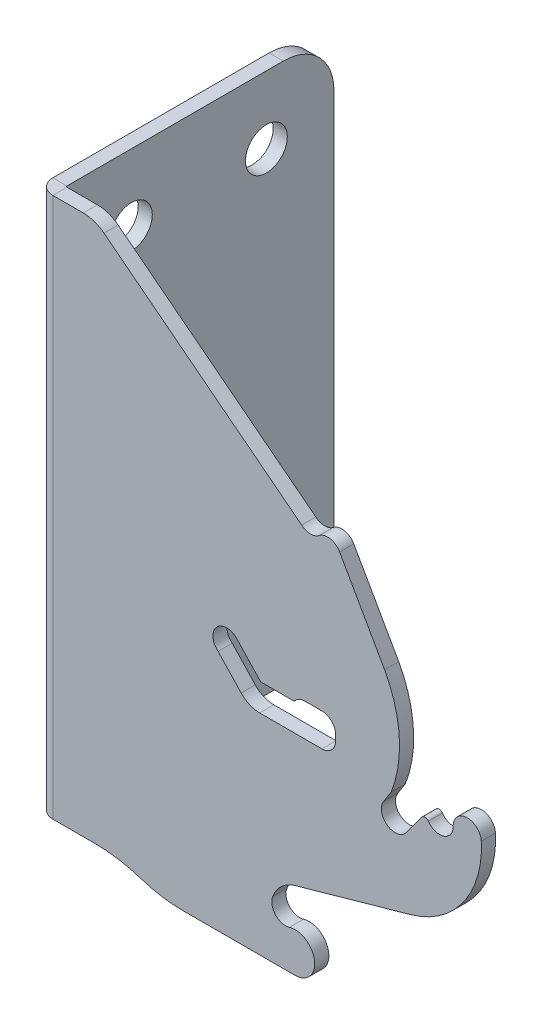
ISO-10303-21;
HEADER;
FILE_DESCRIPTION(('STEP AP214'),'2;1');
FILE_NAME('part.step','',(''),(''),'','','');
FILE_SCHEMA(('AUTOMOTIVE_DESIGN { 1 0 10303 214 1 1 1 1 }'));
ENDSEC;
DATA;
#1=APPLICATION_CONTEXT('core data for automotive mechanical design processes');
#2=APPLICATION_PROTOCOL_DEFINITION('international standard','automotive_design',2000,#1);
#3=PRODUCT_CONTEXT('',#1,'mechanical');
#4=PRODUCT('Part','Part','',(#3));
#5=PRODUCT_RELATED_PRODUCT_CATEGORY('part','',(#4));
#6=PRODUCT_DEFINITION_FORMATION('','',#4);
#7=PRODUCT_DEFINITION_CONTEXT('part definition',#1,'design');
#8=PRODUCT_DEFINITION('design','',#6,#7);
#9=PRODUCT_DEFINITION_SHAPE('','',#8);
#10=(LENGTH_UNIT() NAMED_UNIT(*) SI_UNIT(.MILLI.,.METRE.));
#11=(NAMED_UNIT(*) PLANE_ANGLE_UNIT() SI_UNIT($,.RADIAN.));
#12=(NAMED_UNIT(*) SI_UNIT($,.STERADIAN.) SOLID_ANGLE_UNIT());
#13=UNCERTAINTY_MEASURE_WITH_UNIT(LENGTH_MEASURE(1.E-05),#10,'distance_accuracy_value','');
#14=(GEOMETRIC_REPRESENTATION_CONTEXT(3) GLOBAL_UNCERTAINTY_ASSIGNED_CONTEXT((#13)) GLOBAL_UNIT_ASSIGNED_CONTEXT((#10,
#11,#12)) REPRESENTATION_CONTEXT('',''));
#15=CARTESIAN_POINT('',(0.,0.,0.));
#16=DIRECTION('',(0.,0.,1.));
#17=DIRECTION('',(1.,0.,0.));
#18=AXIS2_PLACEMENT_3D('',#15,#16,#17);
#19=CARTESIAN_POINT('',(8.59326523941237,50.80518022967,-2.65684));
#20=DIRECTION('',(0.,1.,0.));
#21=DIRECTION('',(-1.,0.,0.));
#22=AXIS2_PLACEMENT_3D('',#19,#20,#21);
#23=PLANE('',#22);
#24=DIRECTION('',(-1.,0.,0.));
#25=VECTOR('',#24,1.);
#26=CARTESIAN_POINT('',(8.59326523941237,50.80518022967,-2.65684));
#27=LINE('',#26,#25);
#28=CARTESIAN_POINT('',(8.59326523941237,50.80518022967,-2.65684));
#29=VERTEX_POINT('',#28);
#30=CARTESIAN_POINT('',(2.86004,50.80518022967,-2.65684));
#31=VERTEX_POINT('',#30);
#32=EDGE_CURVE('E531',#29,#31,#27,.T.);
#33=ORIENTED_EDGE('',*,*,#32,.T.);
#34=DIRECTION('',(0.,0.,1.));
#35=VECTOR('',#34,1.);
#36=CARTESIAN_POINT('',(2.86004,50.80518022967,-2.65684));
#37=LINE('',#36,#35);
#38=CARTESIAN_POINT('',(2.86004,50.80518022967,0.));
#39=VERTEX_POINT('',#38);
#40=EDGE_CURVE('E415',#31,#39,#37,.T.);
#41=ORIENTED_EDGE('',*,*,#40,.T.);
#42=DIRECTION('',(-1.,0.,0.));
#43=VECTOR('',#42,1.);
#44=CARTESIAN_POINT('',(8.59326523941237,50.80518022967,0.));
#45=LINE('',#44,#43);
#46=CARTESIAN_POINT('',(8.59326523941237,50.80518022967,0.));
#47=VERTEX_POINT('',#46);
#48=EDGE_CURVE('E594',#47,#39,#45,.T.);
#49=ORIENTED_EDGE('',*,*,#48,.F.);
#50=DIRECTION('',(0.,0.,1.));
#51=VECTOR('',#50,1.);
#52=CARTESIAN_POINT('',(8.59326523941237,50.80518022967,-2.65684));
#53=LINE('',#52,#51);
#54=EDGE_CURVE('E668',#29,#47,#53,.T.);
#55=ORIENTED_EDGE('',*,*,#54,.F.);
#56=EDGE_LOOP('',(#33,#41,#49,#55));
#57=FACE_BOUND('',#56,.T.);
#58=ADVANCED_FACE('F73',(#57),#23,.T.);
#59=CARTESIAN_POINT('',(45.2107386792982,-6.24782505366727,-2.65684));
#60=DIRECTION('',(0.,0.,-1.));
#61=DIRECTION('',(-1.,0.,0.));
#62=AXIS2_PLACEMENT_3D('',#59,#60,#61);
#63=PLANE('',#62);
#64=CARTESIAN_POINT('',(41.7704827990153,-9.27318205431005,-2.65684));
#65=DIRECTION('',(0.,0.,1.));
#66=DIRECTION('',(-1.,0.,0.));
#67=AXIS2_PLACEMENT_3D('',#64,#65,#66);
#68=CIRCLE('',#67,4.77519999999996);
#69=CARTESIAN_POINT('',(38.2917998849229,-12.5444662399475,-2.65684));
#70=VERTEX_POINT('',#69);
#71=CARTESIAN_POINT('',(41.7704827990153,-14.04838205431,-2.65684));
#72=VERTEX_POINT('',#71);
#73=EDGE_CURVE('E424',#70,#72,#68,.T.);
#74=ORIENTED_EDGE('',*,*,#73,.T.);
#75=DIRECTION('',(1.,0.,0.));
#76=VECTOR('',#75,1.);
#77=CARTESIAN_POINT('',(53.4865303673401,-14.04838205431,-2.65684));
#78=LINE('',#77,#76);
#79=CARTESIAN_POINT('',(53.4865303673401,-14.04838205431,-2.65684));
#80=VERTEX_POINT('',#79);
#81=EDGE_CURVE('E427',#72,#80,#78,.T.);
#82=ORIENTED_EDGE('',*,*,#81,.T.);
#83=CARTESIAN_POINT('',(53.4865303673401,-11.4702820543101,-2.65684));
#84=DIRECTION('',(0.,0.,1.));
#85=DIRECTION('',(-1.,0.,0.));
#86=AXIS2_PLACEMENT_3D('',#83,#84,#85);
#87=CIRCLE('',#86,2.57809999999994);
#88=CARTESIAN_POINT('',(56.06463036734,-11.47028205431,-2.65684));
#89=VERTEX_POINT('',#88);
#90=EDGE_CURVE('E431',#80,#89,#87,.T.);
#91=ORIENTED_EDGE('',*,*,#90,.T.);
#92=DIRECTION('',(0.,1.,0.));
#93=VECTOR('',#92,1.);
#94=CARTESIAN_POINT('',(56.06463036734,-11.47028205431,-2.65684));
#95=LINE('',#94,#93);
#96=CARTESIAN_POINT('',(56.06463036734,-10.45428205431,-2.65684));
#97=VERTEX_POINT('',#96);
#98=EDGE_CURVE('E434',#89,#97,#95,.T.);
#99=ORIENTED_EDGE('',*,*,#98,.T.);
#100=CARTESIAN_POINT('',(53.48653036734,-10.45428205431,-2.65684));
#101=DIRECTION('',(0.,0.,1.));
#102=DIRECTION('',(-1.,0.,0.));
#103=AXIS2_PLACEMENT_3D('',#100,#101,#102);
#104=CIRCLE('',#103,2.57810000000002);
#105=CARTESIAN_POINT('',(53.4865303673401,-7.87618205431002,-2.65684));
#106=VERTEX_POINT('',#105);
#107=EDGE_CURVE('E437',#97,#106,#104,.T.);
#108=ORIENTED_EDGE('',*,*,#107,.T.);
#109=DIRECTION('',(-1.,0.,0.));
#110=VECTOR('',#109,1.);
#111=CARTESIAN_POINT('',(53.4865303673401,-7.87618205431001,-2.65684));
#112=LINE('',#111,#110);
#113=CARTESIAN_POINT('',(50.3115303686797,-7.87618205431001,-2.65684));
#114=VERTEX_POINT('',#113);
#115=EDGE_CURVE('E440',#106,#114,#112,.T.);
#116=ORIENTED_EDGE('',*,*,#115,.T.);
#117=CARTESIAN_POINT('',(50.3115303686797,-10.45428205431,-2.65684));
#118=DIRECTION('',(0.,0.,1.));
#119=DIRECTION('',(-1.,0.,0.));
#120=AXIS2_PLACEMENT_3D('',#117,#118,#119);
#121=CIRCLE('',#120,2.57810000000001);
#122=CARTESIAN_POINT('',(48.26056883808,-8.89218205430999,-2.65684));
#123=VERTEX_POINT('',#122);
#124=EDGE_CURVE('E443',#114,#123,#121,.T.);
#125=ORIENTED_EDGE('',*,*,#124,.T.);
#126=DIRECTION('',(-1.,0.,0.));
#127=VECTOR('',#126,1.);
#128=CARTESIAN_POINT('',(41.9699903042,-8.89218205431,-2.65684));
#129=LINE('',#128,#127);
#130=CARTESIAN_POINT('',(41.9699903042,-8.89218205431,-2.65684));
#131=VERTEX_POINT('',#130);
#132=EDGE_CURVE('E446',#123,#131,#129,.T.);
#133=ORIENTED_EDGE('',*,*,#132,.T.);
#134=DIRECTION('',(-0.685056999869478,0.728489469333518,0.));
#135=VECTOR('',#134,1.);
#136=CARTESIAN_POINT('',(41.9699903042,-8.89218205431,-2.65684));
#137=LINE('',#136,#135);
#138=CARTESIAN_POINT('',(37.5111242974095,-4.15062488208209,-2.65684));
#139=VERTEX_POINT('',#138);
#140=EDGE_CURVE('E449',#131,#139,#137,.T.);
#141=ORIENTED_EDGE('',*,*,#140,.T.);
#142=CARTESIAN_POINT('',(35.57614112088,-5.89247802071,-2.65684));
#143=DIRECTION('',(0.,0.,1.));
#144=DIRECTION('',(-1.,0.,0.));
#145=AXIS2_PLACEMENT_3D('',#142,#143,#144);
#146=CIRCLE('',#145,2.60350000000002);
#147=CARTESIAN_POINT('',(33.9433880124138,-7.920365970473,-2.65684));
#148=VERTEX_POINT('',#147);
#149=EDGE_CURVE('E452',#139,#148,#146,.T.);
#150=ORIENTED_EDGE('',*,*,#149,.T.);
#151=DIRECTION('',(0.685056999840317,-0.72848946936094,0.));
#152=VECTOR('',#151,1.);
#153=CARTESIAN_POINT('',(38.2917998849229,-12.5444662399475,-2.65684));
#154=LINE('',#153,#152);
#155=EDGE_CURVE('E455',#148,#70,#154,.T.);
#156=ORIENTED_EDGE('',*,*,#155,.T.);
#157=EDGE_LOOP('',(#74,#82,#91,#99,#108,#116,#125,#133,#141,#150,#156));
#158=FACE_BOUND('',#157,.T.);
#159=DIRECTION('',(1.,0.,0.));
#160=VECTOR('',#159,1.);
#161=CARTESIAN_POINT('',(0.,-50.80518022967,-2.65684));
#162=LINE('',#161,#160);
#163=CARTESIAN_POINT('',(2.86004,-50.80518022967,-2.65684));
#164=VERTEX_POINT('',#163);
#165=CARTESIAN_POINT('',(10.628390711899,-50.80518022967,-2.65684));
#166=VERTEX_POINT('',#165);
#167=EDGE_CURVE('E533',#164,#166,#162,.T.);
#168=ORIENTED_EDGE('',*,*,#167,.F.);
#169=DIRECTION('',(0.,1.,0.));
#170=VECTOR('',#169,1.);
#171=CARTESIAN_POINT('',(2.86004,50.80518022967,-2.65684));
#172=LINE('',#171,#170);
#173=EDGE_CURVE('E90',#31,#164,#172,.F.);
#174=ORIENTED_EDGE('',*,*,#173,.F.);
#175=ORIENTED_EDGE('',*,*,#32,.F.);
#176=CARTESIAN_POINT('',(8.59326523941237,44.45518022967,-2.65684));
#177=DIRECTION('',(0.,0.,1.));
#178=DIRECTION('',(-1.,0.,0.));
#179=AXIS2_PLACEMENT_3D('',#176,#177,#178);
#180=CIRCLE('',#179,6.35000000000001);
#181=CARTESIAN_POINT('',(12.4952036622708,49.4649084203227,-2.65684));
#182=VERTEX_POINT('',#181);
#183=EDGE_CURVE('E528',#182,#29,#180,.T.);
#184=ORIENTED_EDGE('',*,*,#183,.F.);
#185=DIRECTION('',(-0.788933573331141,0.614478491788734,0.));
#186=VECTOR('',#185,1.);
#187=CARTESIAN_POINT('',(12.4952036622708,49.4649084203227,-2.65684));
#188=LINE('',#187,#186);
#189=CARTESIAN_POINT('',(49.6710024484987,20.509709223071,-2.65684));
#190=VERTEX_POINT('',#189);
#191=EDGE_CURVE('E525',#190,#182,#188,.T.);
#192=ORIENTED_EDGE('',*,*,#191,.F.);
#193=CARTESIAN_POINT('',(51.3611104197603,22.4565360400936,-2.65684));
#194=DIRECTION('',(0.,0.,-1.));
#195=DIRECTION('',(-1.,0.,0.));
#196=AXIS2_PLACEMENT_3D('',#193,#194,#195);
#197=CIRCLE('',#196,2.57810000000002);
#198=CARTESIAN_POINT('',(52.9664461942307,20.4392366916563,-2.65684));
#199=VERTEX_POINT('',#198);
#200=EDGE_CURVE('E522',#199,#190,#197,.T.);
#201=ORIENTED_EDGE('',*,*,#200,.F.);
#202=CARTESIAN_POINT('',(54.5717819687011,18.421937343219,-2.65684));
#203=DIRECTION('',(0.,0.,1.));
#204=DIRECTION('',(-1.,0.,0.));
#205=AXIS2_PLACEMENT_3D('',#202,#203,#204);
#206=CIRCLE('',#205,2.57810000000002);
#207=CARTESIAN_POINT('',(56.8159195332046,19.6909709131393,-2.65684));
#208=VERTEX_POINT('',#207);
#209=EDGE_CURVE('E519',#208,#199,#206,.T.);
#210=ORIENTED_EDGE('',*,*,#209,.F.);
#211=DIRECTION('',(-0.492235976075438,0.870461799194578,0.));
#212=VECTOR('',#211,1.);
#213=CARTESIAN_POINT('',(56.8159195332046,19.6909709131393,-2.65684));
#214=LINE('',#213,#212);
#215=CARTESIAN_POINT('',(65.27521176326,4.73170118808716,-2.65684));
#216=VERTEX_POINT('',#215);
#217=EDGE_CURVE('E515',#216,#208,#214,.T.);
#218=ORIENTED_EDGE('',*,*,#217,.F.);
#219=CARTESIAN_POINT('',(45.2107386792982,-6.24782505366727,-2.65684));
#220=DIRECTION('',(0.,0.,1.));
#221=DIRECTION('',(-1.,0.,0.));
#222=AXIS2_PLACEMENT_3D('',#219,#220,#221);
#223=CIRCLE('',#222,22.87210258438);
#224=CARTESIAN_POINT('',(66.5145551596,-14.5713147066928,-2.65684));
#225=VERTEX_POINT('',#224);
#226=EDGE_CURVE('E512',#225,#216,#223,.T.);
#227=ORIENTED_EDGE('',*,*,#226,.F.);
#228=DIRECTION('',(0.537562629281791,0.843223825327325,0.));
#229=VECTOR('',#228,1.);
#230=CARTESIAN_POINT('',(65.1172245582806,-16.7631755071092,-2.65684));
#231=LINE('',#230,#229);
#232=CARTESIAN_POINT('',(65.1172245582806,-16.7631755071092,-2.65684));
#233=VERTEX_POINT('',#232);
#234=EDGE_CURVE('E574',#233,#225,#231,.T.);
#235=ORIENTED_EDGE('',*,*,#234,.F.);
#236=CARTESIAN_POINT('',(67.25739585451,-18.22322220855,-2.65684));
#237=DIRECTION('',(0.,0.,-1.));
#238=DIRECTION('',(-1.,0.,0.));
#239=AXIS2_PLACEMENT_3D('',#236,#237,#238);
#240=CIRCLE('',#239,2.59076620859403);
#241=CARTESIAN_POINT('',(69.3975671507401,-19.68326890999,-2.65684));
#242=VERTEX_POINT('',#241);
#243=EDGE_CURVE('E571',#242,#233,#240,.T.);
#244=ORIENTED_EDGE('',*,*,#243,.F.);
#245=DIRECTION('',(-0.592563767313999,-0.805523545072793,0.));
#246=VECTOR('',#245,1.);
#247=CARTESIAN_POINT('',(69.3975671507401,-19.68326890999,-2.65684));
#248=LINE('',#247,#246);
#249=CARTESIAN_POINT('',(72.23704760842,-15.8233157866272,-2.65684));
#250=VERTEX_POINT('',#249);
#251=EDGE_CURVE('E568',#250,#242,#248,.T.);
#252=ORIENTED_EDGE('',*,*,#251,.F.);
#253=CARTESIAN_POINT('',(72.8643164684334,-16.255956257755,-2.65684));
#254=DIRECTION('',(0.,0.,1.));
#255=DIRECTION('',(-1.,0.,0.));
#256=AXIS2_PLACEMENT_3D('',#253,#254,#255);
#257=CIRCLE('',#256,0.762000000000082);
#258=CARTESIAN_POINT('',(73.4917719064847,-15.8235864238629,-2.65684));
#259=VERTEX_POINT('',#258);
#260=EDGE_CURVE('E565',#259,#250,#257,.T.);
#261=ORIENTED_EDGE('',*,*,#260,.F.);
#262=CARTESIAN_POINT('',(75.6146628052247,-14.3607351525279,-2.65684));
#263=DIRECTION('',(0.,0.,-1.));
#264=DIRECTION('',(-1.,0.,0.));
#265=AXIS2_PLACEMENT_3D('',#262,#263,#264);
#266=CIRCLE('',#265,2.57809999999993);
#267=CARTESIAN_POINT('',(78.187537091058,-14.5248007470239,-2.65684));
#268=VERTEX_POINT('',#267);
#269=EDGE_CURVE('E562',#268,#259,#266,.T.);
#270=ORIENTED_EDGE('',*,*,#269,.F.);
#271=CARTESIAN_POINT('',(80.82398280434,-14.2506660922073,-2.65684));
#272=DIRECTION('',(0.,0.,1.));
#273=DIRECTION('',(-1.,0.,0.));
#274=AXIS2_PLACEMENT_3D('',#271,#272,#273);
#275=CIRCLE('',#274,2.65065950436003);
#276=CARTESIAN_POINT('',(83.4709724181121,-14.1112322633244,-2.65684));
#277=VERTEX_POINT('',#276);
#278=EDGE_CURVE('E559',#277,#268,#275,.T.);
#279=ORIENTED_EDGE('',*,*,#278,.F.);
#280=CARTESIAN_POINT('',(65.1668995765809,-15.0754245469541,-2.65684));
#281=DIRECTION('',(0.,0.,1.));
#282=DIRECTION('',(-1.,0.,0.));
#283=AXIS2_PLACEMENT_3D('',#280,#281,#282);
#284=CIRCLE('',#283,18.3294503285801);
#285=CARTESIAN_POINT('',(70.1446127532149,-32.716034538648,-2.65684));
#286=VERTEX_POINT('',#285);
#287=EDGE_CURVE('E556',#286,#277,#284,.T.);
#288=ORIENTED_EDGE('',*,*,#287,.F.);
#289=DIRECTION('',(0.962418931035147,0.271569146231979,0.));
#290=VECTOR('',#289,1.);
#291=CARTESIAN_POINT('',(70.1446127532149,-32.7160345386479,-2.65684));
#292=LINE('',#291,#290);
#293=CARTESIAN_POINT('',(48.4156542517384,-38.8473714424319,-2.65684));
#294=VERTEX_POINT('',#293);
#295=EDGE_CURVE('E553',#294,#286,#292,.T.);
#296=ORIENTED_EDGE('',*,*,#295,.F.);
#297=CARTESIAN_POINT('',(50.1098774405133,-44.8515604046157,-2.65684));
#298=DIRECTION('',(0.,0.,-1.));
#299=DIRECTION('',(-1.,0.,0.));
#300=AXIS2_PLACEMENT_3D('',#297,#298,#299);
#301=CIRCLE('',#300,6.23864386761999);
#302=CARTESIAN_POINT('',(44.2601728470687,-42.6832353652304,-2.65684));
#303=VERTEX_POINT('',#302);
#304=EDGE_CURVE('E550',#303,#294,#301,.T.);
#305=ORIENTED_EDGE('',*,*,#304,.F.);
#306=CARTESIAN_POINT('',(46.6477291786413,-43.6891277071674,-2.65684));
#307=DIRECTION('',(0.,0.,-1.));
#308=DIRECTION('',(-1.,0.,0.));
#309=AXIS2_PLACEMENT_3D('',#306,#307,#308);
#310=CIRCLE('',#309,2.59080000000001);
#311=CARTESIAN_POINT('',(47.372329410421,-46.1765358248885,-2.65684));
#312=VERTEX_POINT('',#311);
#313=EDGE_CURVE('E547',#312,#303,#310,.T.);
#314=ORIENTED_EDGE('',*,*,#313,.F.);
#315=CARTESIAN_POINT('',(48.4133315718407,-49.75008867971,-2.65684));
#316=DIRECTION('',(0.,0.,1.));
#317=DIRECTION('',(-1.,0.,0.));
#318=AXIS2_PLACEMENT_3D('',#315,#316,#317);
#319=CIRCLE('',#318,3.72209154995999);
#320=CARTESIAN_POINT('',(48.4133315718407,-53.47218022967,-2.65684));
#321=VERTEX_POINT('',#320);
#322=EDGE_CURVE('E544',#321,#312,#319,.T.);
#323=ORIENTED_EDGE('',*,*,#322,.F.);
#324=DIRECTION('',(1.,0.,0.));
#325=VECTOR('',#324,1.);
#326=CARTESIAN_POINT('',(27.3754606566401,-53.47218022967,-2.65684));
#327=LINE('',#326,#325);
#328=CARTESIAN_POINT('',(27.3754606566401,-53.47218022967,-2.65684));
#329=VERTEX_POINT('',#328);
#330=EDGE_CURVE('E541',#329,#321,#327,.T.);
#331=ORIENTED_EDGE('',*,*,#330,.F.);
#332=CARTESIAN_POINT('',(27.3754606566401,-28.07218022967,-2.65684));
#333=DIRECTION('',(0.,0.,1.));
#334=DIRECTION('',(-1.,0.,0.));
#335=AXIS2_PLACEMENT_3D('',#332,#333,#334);
#336=CIRCLE('',#335,25.4);
#337=CARTESIAN_POINT('',(19.4855688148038,-52.2157012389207,-2.65684));
#338=VERTEX_POINT('',#337);
#339=EDGE_CURVE('E538',#338,#329,#336,.T.);
#340=ORIENTED_EDGE('',*,*,#339,.F.);
#341=CARTESIAN_POINT('',(10.628390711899,-79.31917361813,-2.65684));
#342=DIRECTION('',(0.,0.,-1.));
#343=DIRECTION('',(-1.,0.,0.));
#344=AXIS2_PLACEMENT_3D('',#341,#342,#343);
#345=CIRCLE('',#344,28.51399338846);
#346=EDGE_CURVE('E535',#166,#338,#345,.T.);
#347=ORIENTED_EDGE('',*,*,#346,.F.);
#348=EDGE_LOOP('',(#168,#174,#175,#184,#192,#201,#210,#218,#227,#235,#244,#252,#261,#270,#279,
#288,#296,#305,#314,#323,#331,#340,#347));
#349=FACE_BOUND('',#348,.T.);
#350=ADVANCED_FACE('F691',(#158,#349),#63,.T.);
#351=CARTESIAN_POINT('',(45.2107386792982,-6.24782505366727,0.));
#352=DIRECTION('',(0.,0.,-1.));
#353=DIRECTION('',(-1.,0.,0.));
#354=AXIS2_PLACEMENT_3D('',#351,#352,#353);
#355=PLANE('',#354);
#356=DIRECTION('',(1.,0.,0.));
#357=VECTOR('',#356,1.);
#358=CARTESIAN_POINT('',(53.4865303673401,-14.04838205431,0.));
#359=LINE('',#358,#357);
#360=CARTESIAN_POINT('',(41.7704827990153,-14.04838205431,0.));
#361=VERTEX_POINT('',#360);
#362=CARTESIAN_POINT('',(53.4865303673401,-14.04838205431,0.));
#363=VERTEX_POINT('',#362);
#364=EDGE_CURVE('E460',#361,#363,#359,.T.);
#365=ORIENTED_EDGE('',*,*,#364,.F.);
#366=CARTESIAN_POINT('',(41.7704827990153,-9.27318205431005,0.));
#367=DIRECTION('',(0.,0.,1.));
#368=DIRECTION('',(-1.,0.,0.));
#369=AXIS2_PLACEMENT_3D('',#366,#367,#368);
#370=CIRCLE('',#369,4.77519999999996);
#371=CARTESIAN_POINT('',(38.2917998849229,-12.5444662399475,0.));
#372=VERTEX_POINT('',#371);
#373=EDGE_CURVE('E422',#372,#361,#370,.T.);
#374=ORIENTED_EDGE('',*,*,#373,.F.);
#375=DIRECTION('',(0.685056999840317,-0.72848946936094,0.));
#376=VECTOR('',#375,1.);
#377=CARTESIAN_POINT('',(38.2917998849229,-12.5444662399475,0.));
#378=LINE('',#377,#376);
#379=CARTESIAN_POINT('',(33.9433880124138,-7.920365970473,0.));
#380=VERTEX_POINT('',#379);
#381=EDGE_CURVE('E428',#380,#372,#378,.T.);
#382=ORIENTED_EDGE('',*,*,#381,.F.);
#383=CARTESIAN_POINT('',(35.57614112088,-5.89247802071,0.));
#384=DIRECTION('',(0.,0.,1.));
#385=DIRECTION('',(-1.,0.,0.));
#386=AXIS2_PLACEMENT_3D('',#383,#384,#385);
#387=CIRCLE('',#386,2.60350000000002);
#388=CARTESIAN_POINT('',(37.5111242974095,-4.15062488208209,0.));
#389=VERTEX_POINT('',#388);
#390=EDGE_CURVE('E484',#389,#380,#387,.T.);
#391=ORIENTED_EDGE('',*,*,#390,.F.);
#392=DIRECTION('',(-0.685056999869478,0.728489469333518,0.));
#393=VECTOR('',#392,1.);
#394=CARTESIAN_POINT('',(41.9699903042,-8.89218205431,0.));
#395=LINE('',#394,#393);
#396=CARTESIAN_POINT('',(41.9699903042,-8.89218205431,0.));
#397=VERTEX_POINT('',#396);
#398=EDGE_CURVE('E481',#397,#389,#395,.T.);
#399=ORIENTED_EDGE('',*,*,#398,.F.);
#400=DIRECTION('',(-1.,0.,0.));
#401=VECTOR('',#400,1.);
#402=CARTESIAN_POINT('',(41.9699903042,-8.89218205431,0.));
#403=LINE('',#402,#401);
#404=CARTESIAN_POINT('',(48.26056883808,-8.89218205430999,0.));
#405=VERTEX_POINT('',#404);
#406=EDGE_CURVE('E478',#405,#397,#403,.T.);
#407=ORIENTED_EDGE('',*,*,#406,.F.);
#408=CARTESIAN_POINT('',(50.3115303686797,-10.45428205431,0.));
#409=DIRECTION('',(0.,0.,1.));
#410=DIRECTION('',(-1.,0.,0.));
#411=AXIS2_PLACEMENT_3D('',#408,#409,#410);
#412=CIRCLE('',#411,2.57810000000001);
#413=CARTESIAN_POINT('',(50.3115303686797,-7.87618205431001,0.));
#414=VERTEX_POINT('',#413);
#415=EDGE_CURVE('E475',#414,#405,#412,.T.);
#416=ORIENTED_EDGE('',*,*,#415,.F.);
#417=DIRECTION('',(-1.,0.,0.));
#418=VECTOR('',#417,1.);
#419=CARTESIAN_POINT('',(53.4865303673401,-7.87618205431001,0.));
#420=LINE('',#419,#418);
#421=CARTESIAN_POINT('',(53.4865303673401,-7.87618205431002,0.));
#422=VERTEX_POINT('',#421);
#423=EDGE_CURVE('E472',#422,#414,#420,.T.);
#424=ORIENTED_EDGE('',*,*,#423,.F.);
#425=CARTESIAN_POINT('',(53.48653036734,-10.45428205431,0.));
#426=DIRECTION('',(0.,0.,1.));
#427=DIRECTION('',(-1.,0.,0.));
#428=AXIS2_PLACEMENT_3D('',#425,#426,#427);
#429=CIRCLE('',#428,2.57810000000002);
#430=CARTESIAN_POINT('',(56.06463036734,-10.45428205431,0.));
#431=VERTEX_POINT('',#430);
#432=EDGE_CURVE('E469',#431,#422,#429,.T.);
#433=ORIENTED_EDGE('',*,*,#432,.F.);
#434=DIRECTION('',(0.,1.,0.));
#435=VECTOR('',#434,1.);
#436=CARTESIAN_POINT('',(56.06463036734,-11.47028205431,0.));
#437=LINE('',#436,#435);
#438=CARTESIAN_POINT('',(56.06463036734,-11.47028205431,0.));
#439=VERTEX_POINT('',#438);
#440=EDGE_CURVE('E466',#439,#431,#437,.T.);
#441=ORIENTED_EDGE('',*,*,#440,.F.);
#442=CARTESIAN_POINT('',(53.4865303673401,-11.4702820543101,0.));
#443=DIRECTION('',(0.,0.,1.));
#444=DIRECTION('',(-1.,0.,0.));
#445=AXIS2_PLACEMENT_3D('',#442,#443,#444);
#446=CIRCLE('',#445,2.57809999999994);
#447=EDGE_CURVE('E463',#363,#439,#446,.T.);
#448=ORIENTED_EDGE('',*,*,#447,.F.);
#449=EDGE_LOOP('',(#365,#374,#382,#391,#399,#407,#416,#424,#433,#441,#448));
#450=FACE_BOUND('',#449,.T.);
#451=DIRECTION('',(0.,1.,0.));
#452=VECTOR('',#451,1.);
#453=CARTESIAN_POINT('',(2.86004,50.80518022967,0.));
#454=LINE('',#453,#452);
#455=CARTESIAN_POINT('',(2.86004,-50.80518022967,0.));
#456=VERTEX_POINT('',#455);
#457=EDGE_CURVE('E340',#39,#456,#454,.F.);
#458=ORIENTED_EDGE('',*,*,#457,.T.);
#459=DIRECTION('',(1.,0.,0.));
#460=VECTOR('',#459,1.);
#461=CARTESIAN_POINT('',(0.,-50.80518022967,0.));
#462=LINE('',#461,#460);
#463=CARTESIAN_POINT('',(10.628390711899,-50.80518022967,0.));
#464=VERTEX_POINT('',#463);
#465=EDGE_CURVE('E597',#456,#464,#462,.T.);
#466=ORIENTED_EDGE('',*,*,#465,.T.);
#467=CARTESIAN_POINT('',(10.628390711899,-79.31917361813,0.));
#468=DIRECTION('',(0.,0.,-1.));
#469=DIRECTION('',(-1.,0.,0.));
#470=AXIS2_PLACEMENT_3D('',#467,#468,#469);
#471=CIRCLE('',#470,28.51399338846);
#472=CARTESIAN_POINT('',(19.4855688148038,-52.2157012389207,0.));
#473=VERTEX_POINT('',#472);
#474=EDGE_CURVE('E599',#464,#473,#471,.T.);
#475=ORIENTED_EDGE('',*,*,#474,.T.);
#476=CARTESIAN_POINT('',(27.3754606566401,-28.07218022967,0.));
#477=DIRECTION('',(0.,0.,1.));
#478=DIRECTION('',(-1.,0.,0.));
#479=AXIS2_PLACEMENT_3D('',#476,#477,#478);
#480=CIRCLE('',#479,25.4);
#481=CARTESIAN_POINT('',(27.3754606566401,-53.47218022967,0.));
#482=VERTEX_POINT('',#481);
#483=EDGE_CURVE('E602',#473,#482,#480,.T.);
#484=ORIENTED_EDGE('',*,*,#483,.T.);
#485=DIRECTION('',(1.,0.,0.));
#486=VECTOR('',#485,1.);
#487=CARTESIAN_POINT('',(27.3754606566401,-53.47218022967,0.));
#488=LINE('',#487,#486);
#489=CARTESIAN_POINT('',(48.4133315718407,-53.47218022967,0.));
#490=VERTEX_POINT('',#489);
#491=EDGE_CURVE('E605',#482,#490,#488,.T.);
#492=ORIENTED_EDGE('',*,*,#491,.T.);
#493=CARTESIAN_POINT('',(48.4133315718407,-49.75008867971,0.));
#494=DIRECTION('',(0.,0.,1.));
#495=DIRECTION('',(-1.,0.,0.));
#496=AXIS2_PLACEMENT_3D('',#493,#494,#495);
#497=CIRCLE('',#496,3.72209154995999);
#498=CARTESIAN_POINT('',(47.372329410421,-46.1765358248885,0.));
#499=VERTEX_POINT('',#498);
#500=EDGE_CURVE('E608',#490,#499,#497,.T.);
#501=ORIENTED_EDGE('',*,*,#500,.T.);
#502=CARTESIAN_POINT('',(46.6477291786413,-43.6891277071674,0.));
#503=DIRECTION('',(0.,0.,-1.));
#504=DIRECTION('',(-1.,0.,0.));
#505=AXIS2_PLACEMENT_3D('',#502,#503,#504);
#506=CIRCLE('',#505,2.59080000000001);
#507=CARTESIAN_POINT('',(44.2601728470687,-42.6832353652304,0.));
#508=VERTEX_POINT('',#507);
#509=EDGE_CURVE('E611',#499,#508,#506,.T.);
#510=ORIENTED_EDGE('',*,*,#509,.T.);
#511=CARTESIAN_POINT('',(50.1098774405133,-44.8515604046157,0.));
#512=DIRECTION('',(0.,0.,-1.));
#513=DIRECTION('',(-1.,0.,0.));
#514=AXIS2_PLACEMENT_3D('',#511,#512,#513);
#515=CIRCLE('',#514,6.23864386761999);
#516=CARTESIAN_POINT('',(48.4156542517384,-38.8473714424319,0.));
#517=VERTEX_POINT('',#516);
#518=EDGE_CURVE('E614',#508,#517,#515,.T.);
#519=ORIENTED_EDGE('',*,*,#518,.T.);
#520=DIRECTION('',(0.962418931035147,0.271569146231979,0.));
#521=VECTOR('',#520,1.);
#522=CARTESIAN_POINT('',(70.1446127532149,-32.7160345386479,0.));
#523=LINE('',#522,#521);
#524=CARTESIAN_POINT('',(70.1446127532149,-32.716034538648,0.));
#525=VERTEX_POINT('',#524);
#526=EDGE_CURVE('E617',#517,#525,#523,.T.);
#527=ORIENTED_EDGE('',*,*,#526,.T.);
#528=CARTESIAN_POINT('',(65.1668995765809,-15.0754245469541,0.));
#529=DIRECTION('',(0.,0.,1.));
#530=DIRECTION('',(-1.,0.,0.));
#531=AXIS2_PLACEMENT_3D('',#528,#529,#530);
#532=CIRCLE('',#531,18.3294503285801);
#533=CARTESIAN_POINT('',(83.4709724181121,-14.1112322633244,0.));
#534=VERTEX_POINT('',#533);
#535=EDGE_CURVE('E620',#525,#534,#532,.T.);
#536=ORIENTED_EDGE('',*,*,#535,.T.);
#537=CARTESIAN_POINT('',(80.82398280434,-14.2506660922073,0.));
#538=DIRECTION('',(0.,0.,1.));
#539=DIRECTION('',(-1.,0.,0.));
#540=AXIS2_PLACEMENT_3D('',#537,#538,#539);
#541=CIRCLE('',#540,2.65065950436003);
#542=CARTESIAN_POINT('',(78.187537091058,-14.5248007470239,0.));
#543=VERTEX_POINT('',#542);
#544=EDGE_CURVE('E623',#534,#543,#541,.T.);
#545=ORIENTED_EDGE('',*,*,#544,.T.);
#546=CARTESIAN_POINT('',(75.6146628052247,-14.3607351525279,0.));
#547=DIRECTION('',(0.,0.,-1.));
#548=DIRECTION('',(-1.,0.,0.));
#549=AXIS2_PLACEMENT_3D('',#546,#547,#548);
#550=CIRCLE('',#549,2.57809999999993);
#551=CARTESIAN_POINT('',(73.4917719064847,-15.8235864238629,0.));
#552=VERTEX_POINT('',#551);
#553=EDGE_CURVE('E626',#543,#552,#550,.T.);
#554=ORIENTED_EDGE('',*,*,#553,.T.);
#555=CARTESIAN_POINT('',(72.8643164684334,-16.255956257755,0.));
#556=DIRECTION('',(0.,0.,1.));
#557=DIRECTION('',(-1.,0.,0.));
#558=AXIS2_PLACEMENT_3D('',#555,#556,#557);
#559=CIRCLE('',#558,0.762000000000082);
#560=CARTESIAN_POINT('',(72.23704760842,-15.8233157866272,0.));
#561=VERTEX_POINT('',#560);
#562=EDGE_CURVE('E629',#552,#561,#559,.T.);
#563=ORIENTED_EDGE('',*,*,#562,.T.);
#564=DIRECTION('',(-0.592563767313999,-0.805523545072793,0.));
#565=VECTOR('',#564,1.);
#566=CARTESIAN_POINT('',(69.3975671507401,-19.68326890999,0.));
#567=LINE('',#566,#565);
#568=CARTESIAN_POINT('',(69.3975671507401,-19.68326890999,0.));
#569=VERTEX_POINT('',#568);
#570=EDGE_CURVE('E632',#561,#569,#567,.T.);
#571=ORIENTED_EDGE('',*,*,#570,.T.);
#572=CARTESIAN_POINT('',(67.25739585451,-18.22322220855,0.));
#573=DIRECTION('',(0.,0.,-1.));
#574=DIRECTION('',(-1.,0.,0.));
#575=AXIS2_PLACEMENT_3D('',#572,#573,#574);
#576=CIRCLE('',#575,2.59076620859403);
#577=CARTESIAN_POINT('',(65.1172245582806,-16.7631755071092,0.));
#578=VERTEX_POINT('',#577);
#579=EDGE_CURVE('E635',#569,#578,#576,.T.);
#580=ORIENTED_EDGE('',*,*,#579,.T.);
#581=DIRECTION('',(0.537562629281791,0.843223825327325,0.));
#582=VECTOR('',#581,1.);
#583=CARTESIAN_POINT('',(65.1172245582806,-16.7631755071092,0.));
#584=LINE('',#583,#582);
#585=CARTESIAN_POINT('',(66.5145551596,-14.5713147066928,0.));
#586=VERTEX_POINT('',#585);
#587=EDGE_CURVE('E516',#578,#586,#584,.T.);
#588=ORIENTED_EDGE('',*,*,#587,.T.);
#589=CARTESIAN_POINT('',(45.2107386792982,-6.24782505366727,0.));
#590=DIRECTION('',(0.,0.,1.));
#591=DIRECTION('',(-1.,0.,0.));
#592=AXIS2_PLACEMENT_3D('',#589,#590,#591);
#593=CIRCLE('',#592,22.87210258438);
#594=CARTESIAN_POINT('',(65.27521176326,4.73170118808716,0.));
#595=VERTEX_POINT('',#594);
#596=EDGE_CURVE('E491',#586,#595,#593,.T.);
#597=ORIENTED_EDGE('',*,*,#596,.T.);
#598=DIRECTION('',(-0.492235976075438,0.870461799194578,0.));
#599=VECTOR('',#598,1.);
#600=CARTESIAN_POINT('',(56.8159195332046,19.6909709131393,0.));
#601=LINE('',#600,#599);
#602=CARTESIAN_POINT('',(56.8159195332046,19.6909709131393,0.));
#603=VERTEX_POINT('',#602);
#604=EDGE_CURVE('E579',#595,#603,#601,.T.);
#605=ORIENTED_EDGE('',*,*,#604,.T.);
#606=CARTESIAN_POINT('',(54.5717819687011,18.421937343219,0.));
#607=DIRECTION('',(0.,0.,1.));
#608=DIRECTION('',(-1.,0.,0.));
#609=AXIS2_PLACEMENT_3D('',#606,#607,#608);
#610=CIRCLE('',#609,2.57810000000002);
#611=CARTESIAN_POINT('',(52.9664461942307,20.4392366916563,0.));
#612=VERTEX_POINT('',#611);
#613=EDGE_CURVE('E582',#603,#612,#610,.T.);
#614=ORIENTED_EDGE('',*,*,#613,.T.);
#615=CARTESIAN_POINT('',(51.3611104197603,22.4565360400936,0.));
#616=DIRECTION('',(0.,0.,-1.));
#617=DIRECTION('',(-1.,0.,0.));
#618=AXIS2_PLACEMENT_3D('',#615,#616,#617);
#619=CIRCLE('',#618,2.57810000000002);
#620=CARTESIAN_POINT('',(49.6710024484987,20.509709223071,0.));
#621=VERTEX_POINT('',#620);
#622=EDGE_CURVE('E585',#612,#621,#619,.T.);
#623=ORIENTED_EDGE('',*,*,#622,.T.);
#624=DIRECTION('',(-0.788933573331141,0.614478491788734,0.));
#625=VECTOR('',#624,1.);
#626=CARTESIAN_POINT('',(12.4952036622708,49.4649084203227,0.));
#627=LINE('',#626,#625);
#628=CARTESIAN_POINT('',(12.4952036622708,49.4649084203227,0.));
#629=VERTEX_POINT('',#628);
#630=EDGE_CURVE('E588',#621,#629,#627,.T.);
#631=ORIENTED_EDGE('',*,*,#630,.T.);
#632=CARTESIAN_POINT('',(8.59326523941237,44.45518022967,0.));
#633=DIRECTION('',(0.,0.,1.));
#634=DIRECTION('',(-1.,0.,0.));
#635=AXIS2_PLACEMENT_3D('',#632,#633,#634);
#636=CIRCLE('',#635,6.35000000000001);
#637=EDGE_CURVE('E591',#629,#47,#636,.T.);
#638=ORIENTED_EDGE('',*,*,#637,.T.);
#639=ORIENTED_EDGE('',*,*,#48,.T.);
#640=EDGE_LOOP('',(#458,#466,#475,#484,#492,#501,#510,#519,#527,#536,#545,#554,#563,#571,#580,
#588,#597,#605,#614,#623,#631,#638,#639));
#641=FACE_BOUND('',#640,.T.);
#642=ADVANCED_FACE('F685',(#450,#641),#355,.F.);
#643=CARTESIAN_POINT('',(45.2107386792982,-6.24782505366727,-2.65684));
#644=DIRECTION('',(0.,0.,1.));
#645=DIRECTION('',(1.,0.,0.));
#646=AXIS2_PLACEMENT_3D('',#643,#644,#645);
#647=CYLINDRICAL_SURFACE('',#646,22.87210258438);
#648=ORIENTED_EDGE('',*,*,#596,.F.);
#649=DIRECTION('',(0.,0.,1.));
#650=VECTOR('',#649,1.);
#651=CARTESIAN_POINT('',(66.5145551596,-14.5713147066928,-2.65684));
#652=LINE('',#651,#650);
#653=EDGE_CURVE('E13',#225,#586,#652,.T.);
#654=ORIENTED_EDGE('',*,*,#653,.F.);
#655=ORIENTED_EDGE('',*,*,#226,.T.);
#656=DIRECTION('',(0.,0.,1.));
#657=VECTOR('',#656,1.);
#658=CARTESIAN_POINT('',(65.27521176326,4.73170118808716,-2.65684));
#659=LINE('',#658,#657);
#660=EDGE_CURVE('E77',#216,#595,#659,.T.);
#661=ORIENTED_EDGE('',*,*,#660,.T.);
#662=EDGE_LOOP('',(#648,#654,#655,#661));
#663=FACE_BOUND('',#662,.T.);
#664=ADVANCED_FACE('F75',(#663),#647,.T.);
#665=CARTESIAN_POINT('',(65.1172245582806,-16.7631755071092,-2.65684));
#666=DIRECTION('',(0.843223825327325,-0.537562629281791,0.));
#667=DIRECTION('',(0.537562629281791,0.843223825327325,0.));
#668=AXIS2_PLACEMENT_3D('',#665,#666,#667);
#669=PLANE('',#668);
#670=ORIENTED_EDGE('',*,*,#587,.F.);
#671=DIRECTION('',(0.,0.,1.));
#672=VECTOR('',#671,1.);
#673=CARTESIAN_POINT('',(65.1172245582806,-16.7631755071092,-2.65684));
#674=LINE('',#673,#672);
#675=EDGE_CURVE('E82',#233,#578,#674,.T.);
#676=ORIENTED_EDGE('',*,*,#675,.F.);
#677=ORIENTED_EDGE('',*,*,#234,.T.);
#678=ORIENTED_EDGE('',*,*,#653,.T.);
#679=EDGE_LOOP('',(#670,#676,#677,#678));
#680=FACE_BOUND('',#679,.T.);
#681=ADVANCED_FACE('F689',(#680),#669,.T.);
#682=CARTESIAN_POINT('',(67.25739585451,-18.22322220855,-2.65684));
#683=DIRECTION('',(0.,0.,1.));
#684=DIRECTION('',(1.,0.,0.));
#685=AXIS2_PLACEMENT_3D('',#682,#683,#684);
#686=CYLINDRICAL_SURFACE('',#685,2.59076620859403);
#687=ORIENTED_EDGE('',*,*,#579,.F.);
#688=DIRECTION('',(0.,0.,1.));
#689=VECTOR('',#688,1.);
#690=CARTESIAN_POINT('',(69.3975671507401,-19.68326890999,-2.65684));
#691=LINE('',#690,#689);
#692=EDGE_CURVE('E641',#242,#569,#691,.T.);
#693=ORIENTED_EDGE('',*,*,#692,.F.);
#694=ORIENTED_EDGE('',*,*,#243,.T.);
#695=ORIENTED_EDGE('',*,*,#675,.T.);
#696=EDGE_LOOP('',(#687,#693,#694,#695));
#697=FACE_BOUND('',#696,.T.);
#698=ADVANCED_FACE('F799',(#697),#686,.F.);
#699=CARTESIAN_POINT('',(69.3975671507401,-19.68326890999,-2.65684));
#700=DIRECTION('',(-0.805523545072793,0.592563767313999,0.));
#701=DIRECTION('',(-0.592563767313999,-0.805523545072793,0.));
#702=AXIS2_PLACEMENT_3D('',#699,#700,#701);
#703=PLANE('',#702);
#704=ORIENTED_EDGE('',*,*,#570,.F.);
#705=DIRECTION('',(0.,0.,1.));
#706=VECTOR('',#705,1.);
#707=CARTESIAN_POINT('',(72.23704760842,-15.8233157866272,-2.65684));
#708=LINE('',#707,#706);
#709=EDGE_CURVE('E643',#250,#561,#708,.T.);
#710=ORIENTED_EDGE('',*,*,#709,.F.);
#711=ORIENTED_EDGE('',*,*,#251,.T.);
#712=ORIENTED_EDGE('',*,*,#692,.T.);
#713=EDGE_LOOP('',(#704,#710,#711,#712));
#714=FACE_BOUND('',#713,.T.);
#715=ADVANCED_FACE('F802',(#714),#703,.T.);
#716=CARTESIAN_POINT('',(72.8643164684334,-16.255956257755,-2.65684));
#717=DIRECTION('',(0.,0.,1.));
#718=DIRECTION('',(1.,0.,0.));
#719=AXIS2_PLACEMENT_3D('',#716,#717,#718);
#720=CYLINDRICAL_SURFACE('',#719,0.762000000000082);
#721=ORIENTED_EDGE('',*,*,#562,.F.);
#722=DIRECTION('',(0.,0.,1.));
#723=VECTOR('',#722,1.);
#724=CARTESIAN_POINT('',(73.4917719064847,-15.8235864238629,-2.65684));
#725=LINE('',#724,#723);
#726=EDGE_CURVE('E645',#259,#552,#725,.T.);
#727=ORIENTED_EDGE('',*,*,#726,.F.);
#728=ORIENTED_EDGE('',*,*,#260,.T.);
#729=ORIENTED_EDGE('',*,*,#709,.T.);
#730=EDGE_LOOP('',(#721,#727,#728,#729));
#731=FACE_BOUND('',#730,.T.);
#732=ADVANCED_FACE('F806',(#731),#720,.T.);
#733=CARTESIAN_POINT('',(75.6146628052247,-14.3607351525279,-2.65684));
#734=DIRECTION('',(0.,0.,1.));
#735=DIRECTION('',(1.,0.,0.));
#736=AXIS2_PLACEMENT_3D('',#733,#734,#735);
#737=CYLINDRICAL_SURFACE('',#736,2.57809999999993);
#738=ORIENTED_EDGE('',*,*,#553,.F.);
#739=DIRECTION('',(0.,0.,1.));
#740=VECTOR('',#739,1.);
#741=CARTESIAN_POINT('',(78.187537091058,-14.5248007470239,-2.65684));
#742=LINE('',#741,#740);
#743=EDGE_CURVE('E647',#268,#543,#742,.T.);
#744=ORIENTED_EDGE('',*,*,#743,.F.);
#745=ORIENTED_EDGE('',*,*,#269,.T.);
#746=ORIENTED_EDGE('',*,*,#726,.T.);
#747=EDGE_LOOP('',(#738,#744,#745,#746));
#748=FACE_BOUND('',#747,.T.);
#749=ADVANCED_FACE('F810',(#748),#737,.F.);
#750=CARTESIAN_POINT('',(80.82398280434,-14.2506660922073,-2.65684));
#751=DIRECTION('',(0.,0.,1.));
#752=DIRECTION('',(1.,0.,0.));
#753=AXIS2_PLACEMENT_3D('',#750,#751,#752);
#754=CYLINDRICAL_SURFACE('',#753,2.65065950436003);
#755=ORIENTED_EDGE('',*,*,#544,.F.);
#756=DIRECTION('',(0.,0.,1.));
#757=VECTOR('',#756,1.);
#758=CARTESIAN_POINT('',(83.4709724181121,-14.1112322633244,-2.65684));
#759=LINE('',#758,#757);
#760=EDGE_CURVE('E649',#277,#534,#759,.T.);
#761=ORIENTED_EDGE('',*,*,#760,.F.);
#762=ORIENTED_EDGE('',*,*,#278,.T.);
#763=ORIENTED_EDGE('',*,*,#743,.T.);
#764=EDGE_LOOP('',(#755,#761,#762,#763));
#765=FACE_BOUND('',#764,.T.);
#766=ADVANCED_FACE('F814',(#765),#754,.T.);
#767=CARTESIAN_POINT('',(65.1668995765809,-15.0754245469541,-2.65684));
#768=DIRECTION('',(0.,0.,1.));
#769=DIRECTION('',(1.,0.,0.));
#770=AXIS2_PLACEMENT_3D('',#767,#768,#769);
#771=CYLINDRICAL_SURFACE('',#770,18.3294503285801);
#772=ORIENTED_EDGE('',*,*,#535,.F.);
#773=DIRECTION('',(0.,0.,1.));
#774=VECTOR('',#773,1.);
#775=CARTESIAN_POINT('',(70.1446127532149,-32.716034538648,-2.65684));
#776=LINE('',#775,#774);
#777=EDGE_CURVE('E651',#286,#525,#776,.T.);
#778=ORIENTED_EDGE('',*,*,#777,.F.);
#779=ORIENTED_EDGE('',*,*,#287,.T.);
#780=ORIENTED_EDGE('',*,*,#760,.T.);
#781=EDGE_LOOP('',(#772,#778,#779,#780));
#782=FACE_BOUND('',#781,.T.);
#783=ADVANCED_FACE('F818',(#782),#771,.T.);
#784=CARTESIAN_POINT('',(70.1446127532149,-32.7160345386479,-2.65684));
#785=DIRECTION('',(0.271569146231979,-0.962418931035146,0.));
#786=DIRECTION('',(0.962418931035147,0.271569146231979,0.));
#787=AXIS2_PLACEMENT_3D('',#784,#785,#786);
#788=PLANE('',#787);
#789=ORIENTED_EDGE('',*,*,#526,.F.);
#790=DIRECTION('',(0.,0.,1.));
#791=VECTOR('',#790,1.);
#792=CARTESIAN_POINT('',(48.4156542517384,-38.8473714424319,-2.65684));
#793=LINE('',#792,#791);
#794=EDGE_CURVE('E653',#294,#517,#793,.T.);
#795=ORIENTED_EDGE('',*,*,#794,.F.);
#796=ORIENTED_EDGE('',*,*,#295,.T.);
#797=ORIENTED_EDGE('',*,*,#777,.T.);
#798=EDGE_LOOP('',(#789,#795,#796,#797));
#799=FACE_BOUND('',#798,.T.);
#800=ADVANCED_FACE('F822',(#799),#788,.T.);
#801=CARTESIAN_POINT('',(50.1098774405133,-44.8515604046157,-2.65684));
#802=DIRECTION('',(0.,0.,1.));
#803=DIRECTION('',(1.,0.,0.));
#804=AXIS2_PLACEMENT_3D('',#801,#802,#803);
#805=CYLINDRICAL_SURFACE('',#804,6.23864386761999);
#806=ORIENTED_EDGE('',*,*,#518,.F.);
#807=DIRECTION('',(0.,0.,1.));
#808=VECTOR('',#807,1.);
#809=CARTESIAN_POINT('',(44.2601728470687,-42.6832353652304,-2.65684));
#810=LINE('',#809,#808);
#811=EDGE_CURVE('E655',#303,#508,#810,.T.);
#812=ORIENTED_EDGE('',*,*,#811,.F.);
#813=ORIENTED_EDGE('',*,*,#304,.T.);
#814=ORIENTED_EDGE('',*,*,#794,.T.);
#815=EDGE_LOOP('',(#806,#812,#813,#814));
#816=FACE_BOUND('',#815,.T.);
#817=ADVANCED_FACE('F826',(#816),#805,.F.);
#818=CARTESIAN_POINT('',(46.6477291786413,-43.6891277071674,-2.65684));
#819=DIRECTION('',(0.,0.,1.));
#820=DIRECTION('',(1.,0.,0.));
#821=AXIS2_PLACEMENT_3D('',#818,#819,#820);
#822=CYLINDRICAL_SURFACE('',#821,2.59080000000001);
#823=ORIENTED_EDGE('',*,*,#509,.F.);
#824=DIRECTION('',(0.,0.,1.));
#825=VECTOR('',#824,1.);
#826=CARTESIAN_POINT('',(47.372329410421,-46.1765358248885,-2.65684));
#827=LINE('',#826,#825);
#828=EDGE_CURVE('E657',#312,#499,#827,.T.);
#829=ORIENTED_EDGE('',*,*,#828,.F.);
#830=ORIENTED_EDGE('',*,*,#313,.T.);
#831=ORIENTED_EDGE('',*,*,#811,.T.);
#832=EDGE_LOOP('',(#823,#829,#830,#831));
#833=FACE_BOUND('',#832,.T.);
#834=ADVANCED_FACE('F830',(#833),#822,.F.);
#835=CARTESIAN_POINT('',(48.4133315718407,-49.75008867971,-2.65684));
#836=DIRECTION('',(0.,0.,1.));
#837=DIRECTION('',(1.,0.,0.));
#838=AXIS2_PLACEMENT_3D('',#835,#836,#837);
#839=CYLINDRICAL_SURFACE('',#838,3.72209154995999);
#840=ORIENTED_EDGE('',*,*,#500,.F.);
#841=DIRECTION('',(0.,0.,1.));
#842=VECTOR('',#841,1.);
#843=CARTESIAN_POINT('',(48.4133315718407,-53.47218022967,-2.65684));
#844=LINE('',#843,#842);
#845=EDGE_CURVE('E659',#321,#490,#844,.T.);
#846=ORIENTED_EDGE('',*,*,#845,.F.);
#847=ORIENTED_EDGE('',*,*,#322,.T.);
#848=ORIENTED_EDGE('',*,*,#828,.T.);
#849=EDGE_LOOP('',(#840,#846,#847,#848));
#850=FACE_BOUND('',#849,.T.);
#851=ADVANCED_FACE('F834',(#850),#839,.T.);
#852=CARTESIAN_POINT('',(27.3754606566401,-53.47218022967,-2.65684));
#853=DIRECTION('',(0.,-1.,0.));
#854=DIRECTION('',(0.,0.,-1.));
#855=AXIS2_PLACEMENT_3D('',#852,#853,#854);
#856=PLANE('',#855);
#857=ORIENTED_EDGE('',*,*,#491,.F.);
#858=DIRECTION('',(0.,0.,1.));
#859=VECTOR('',#858,1.);
#860=CARTESIAN_POINT('',(27.3754606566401,-53.47218022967,-2.65684));
#861=LINE('',#860,#859);
#862=EDGE_CURVE('E661',#329,#482,#861,.T.);
#863=ORIENTED_EDGE('',*,*,#862,.F.);
#864=ORIENTED_EDGE('',*,*,#330,.T.);
#865=ORIENTED_EDGE('',*,*,#845,.T.);
#866=EDGE_LOOP('',(#857,#863,#864,#865));
#867=FACE_BOUND('',#866,.T.);
#868=ADVANCED_FACE('F838',(#867),#856,.T.);
#869=CARTESIAN_POINT('',(27.3754606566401,-28.07218022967,-2.65684));
#870=DIRECTION('',(0.,0.,1.));
#871=DIRECTION('',(1.,0.,0.));
#872=AXIS2_PLACEMENT_3D('',#869,#870,#871);
#873=CYLINDRICAL_SURFACE('',#872,25.4);
#874=ORIENTED_EDGE('',*,*,#483,.F.);
#875=DIRECTION('',(0.,0.,1.));
#876=VECTOR('',#875,1.);
#877=CARTESIAN_POINT('',(19.4855688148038,-52.2157012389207,-2.65684));
#878=LINE('',#877,#876);
#879=EDGE_CURVE('E663',#338,#473,#878,.T.);
#880=ORIENTED_EDGE('',*,*,#879,.F.);
#881=ORIENTED_EDGE('',*,*,#339,.T.);
#882=ORIENTED_EDGE('',*,*,#862,.T.);
#883=EDGE_LOOP('',(#874,#880,#881,#882));
#884=FACE_BOUND('',#883,.T.);
#885=ADVANCED_FACE('F842',(#884),#873,.T.);
#886=CARTESIAN_POINT('',(10.628390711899,-79.31917361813,-2.65684));
#887=DIRECTION('',(0.,0.,1.));
#888=DIRECTION('',(1.,0.,0.));
#889=AXIS2_PLACEMENT_3D('',#886,#887,#888);
#890=CYLINDRICAL_SURFACE('',#889,28.51399338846);
#891=ORIENTED_EDGE('',*,*,#474,.F.);
#892=DIRECTION('',(0.,0.,1.));
#893=VECTOR('',#892,1.);
#894=CARTESIAN_POINT('',(10.628390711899,-50.80518022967,-2.65684));
#895=LINE('',#894,#893);
#896=EDGE_CURVE('E665',#166,#464,#895,.T.);
#897=ORIENTED_EDGE('',*,*,#896,.F.);
#898=ORIENTED_EDGE('',*,*,#346,.T.);
#899=ORIENTED_EDGE('',*,*,#879,.T.);
#900=EDGE_LOOP('',(#891,#897,#898,#899));
#901=FACE_BOUND('',#900,.T.);
#902=ADVANCED_FACE('F845',(#901),#890,.F.);
#903=CARTESIAN_POINT('',(0.,-50.80518022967,-2.65684));
#904=DIRECTION('',(0.,-1.,0.));
#905=DIRECTION('',(0.,0.,-1.));
#906=AXIS2_PLACEMENT_3D('',#903,#904,#905);
#907=PLANE('',#906);
#908=DIRECTION('',(0.,0.,1.));
#909=VECTOR('',#908,1.);
#910=CARTESIAN_POINT('',(2.86004,-50.80518022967,-2.65684));
#911=LINE('',#910,#909);
#912=EDGE_CURVE('E98',#164,#456,#911,.T.);
#913=ORIENTED_EDGE('',*,*,#912,.F.);
#914=ORIENTED_EDGE('',*,*,#167,.T.);
#915=ORIENTED_EDGE('',*,*,#896,.T.);
#916=ORIENTED_EDGE('',*,*,#465,.F.);
#917=EDGE_LOOP('',(#913,#914,#915,#916));
#918=FACE_BOUND('',#917,.T.);
#919=ADVANCED_FACE('F769',(#918),#907,.T.);
#920=CARTESIAN_POINT('',(8.59326523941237,44.45518022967,-2.65684));
#921=DIRECTION('',(0.,0.,1.));
#922=DIRECTION('',(1.,0.,0.));
#923=AXIS2_PLACEMENT_3D('',#920,#921,#922);
#924=CYLINDRICAL_SURFACE('',#923,6.35000000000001);
#925=ORIENTED_EDGE('',*,*,#637,.F.);
#926=DIRECTION('',(0.,0.,1.));
#927=VECTOR('',#926,1.);
#928=CARTESIAN_POINT('',(12.4952036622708,49.4649084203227,-2.65684));
#929=LINE('',#928,#927);
#930=EDGE_CURVE('E670',#182,#629,#929,.T.);
#931=ORIENTED_EDGE('',*,*,#930,.F.);
#932=ORIENTED_EDGE('',*,*,#183,.T.);
#933=ORIENTED_EDGE('',*,*,#54,.T.);
#934=EDGE_LOOP('',(#925,#931,#932,#933));
#935=FACE_BOUND('',#934,.T.);
#936=ADVANCED_FACE('F707',(#935),#924,.T.);
#937=CARTESIAN_POINT('',(12.4952036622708,49.4649084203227,-2.65684));
#938=DIRECTION('',(0.614478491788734,0.788933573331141,0.));
#939=DIRECTION('',(-0.788933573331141,0.614478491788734,0.));
#940=AXIS2_PLACEMENT_3D('',#937,#938,#939);
#941=PLANE('',#940);
#942=ORIENTED_EDGE('',*,*,#630,.F.);
#943=DIRECTION('',(0.,0.,1.));
#944=VECTOR('',#943,1.);
#945=CARTESIAN_POINT('',(49.6710024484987,20.509709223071,-2.65684));
#946=LINE('',#945,#944);
#947=EDGE_CURVE('E672',#190,#621,#946,.T.);
#948=ORIENTED_EDGE('',*,*,#947,.F.);
#949=ORIENTED_EDGE('',*,*,#191,.T.);
#950=ORIENTED_EDGE('',*,*,#930,.T.);
#951=EDGE_LOOP('',(#942,#948,#949,#950));
#952=FACE_BOUND('',#951,.T.);
#953=ADVANCED_FACE('F703',(#952),#941,.T.);
#954=CARTESIAN_POINT('',(51.3611104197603,22.4565360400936,-2.65684));
#955=DIRECTION('',(0.,0.,1.));
#956=DIRECTION('',(1.,0.,0.));
#957=AXIS2_PLACEMENT_3D('',#954,#955,#956);
#958=CYLINDRICAL_SURFACE('',#957,2.57810000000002);
#959=ORIENTED_EDGE('',*,*,#622,.F.);
#960=DIRECTION('',(0.,0.,1.));
#961=VECTOR('',#960,1.);
#962=CARTESIAN_POINT('',(52.9664461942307,20.4392366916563,-2.65684));
#963=LINE('',#962,#961);
#964=EDGE_CURVE('E674',#199,#612,#963,.T.);
#965=ORIENTED_EDGE('',*,*,#964,.F.);
#966=ORIENTED_EDGE('',*,*,#200,.T.);
#967=ORIENTED_EDGE('',*,*,#947,.T.);
#968=EDGE_LOOP('',(#959,#965,#966,#967));
#969=FACE_BOUND('',#968,.T.);
#970=ADVANCED_FACE('F701',(#969),#958,.F.);
#971=CARTESIAN_POINT('',(54.5717819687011,18.421937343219,-2.65684));
#972=DIRECTION('',(0.,0.,1.));
#973=DIRECTION('',(1.,0.,0.));
#974=AXIS2_PLACEMENT_3D('',#971,#972,#973);
#975=CYLINDRICAL_SURFACE('',#974,2.57810000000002);
#976=ORIENTED_EDGE('',*,*,#613,.F.);
#977=DIRECTION('',(0.,0.,1.));
#978=VECTOR('',#977,1.);
#979=CARTESIAN_POINT('',(56.8159195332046,19.6909709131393,-2.65684));
#980=LINE('',#979,#978);
#981=EDGE_CURVE('E675',#208,#603,#980,.T.);
#982=ORIENTED_EDGE('',*,*,#981,.F.);
#983=ORIENTED_EDGE('',*,*,#209,.T.);
#984=ORIENTED_EDGE('',*,*,#964,.T.);
#985=EDGE_LOOP('',(#976,#982,#983,#984));
#986=FACE_BOUND('',#985,.T.);
#987=ADVANCED_FACE('F697',(#986),#975,.T.);
#988=CARTESIAN_POINT('',(56.8159195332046,19.6909709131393,-2.65684));
#989=DIRECTION('',(0.870461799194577,0.492235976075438,0.));
#990=DIRECTION('',(-0.492235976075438,0.870461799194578,0.));
#991=AXIS2_PLACEMENT_3D('',#988,#989,#990);
#992=PLANE('',#991);
#993=ORIENTED_EDGE('',*,*,#604,.F.);
#994=ORIENTED_EDGE('',*,*,#660,.F.);
#995=ORIENTED_EDGE('',*,*,#217,.T.);
#996=ORIENTED_EDGE('',*,*,#981,.T.);
#997=EDGE_LOOP('',(#993,#994,#995,#996));
#998=FACE_BOUND('',#997,.T.);
#999=ADVANCED_FACE('F683',(#998),#992,.T.);
#1000=CARTESIAN_POINT('',(41.7704827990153,-9.27318205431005,-2.65684));
#1001=DIRECTION('',(0.,0.,1.));
#1002=DIRECTION('',(1.,0.,0.));
#1003=AXIS2_PLACEMENT_3D('',#1000,#1001,#1002);
#1004=CYLINDRICAL_SURFACE('',#1003,4.77519999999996);
#1005=ORIENTED_EDGE('',*,*,#373,.T.);
#1006=DIRECTION('',(0.,0.,1.));
#1007=VECTOR('',#1006,1.);
#1008=CARTESIAN_POINT('',(41.7704827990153,-14.04838205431,-2.65684));
#1009=LINE('',#1008,#1007);
#1010=EDGE_CURVE('E458',#72,#361,#1009,.T.);
#1011=ORIENTED_EDGE('',*,*,#1010,.F.);
#1012=ORIENTED_EDGE('',*,*,#73,.F.);
#1013=DIRECTION('',(0.,0.,1.));
#1014=VECTOR('',#1013,1.);
#1015=CARTESIAN_POINT('',(38.2917998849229,-12.5444662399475,-2.65684));
#1016=LINE('',#1015,#1014);
#1017=EDGE_CURVE('E489',#70,#372,#1016,.T.);
#1018=ORIENTED_EDGE('',*,*,#1017,.T.);
#1019=EDGE_LOOP('',(#1005,#1011,#1012,#1018));
#1020=FACE_BOUND('',#1019,.T.);
#1021=ADVANCED_FACE('F779',(#1020),#1004,.F.);
#1022=CARTESIAN_POINT('',(38.2917998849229,-12.5444662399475,-2.65684));
#1023=DIRECTION('',(-0.72848946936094,-0.685056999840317,0.));
#1024=DIRECTION('',(0.685056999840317,-0.72848946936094,0.));
#1025=AXIS2_PLACEMENT_3D('',#1022,#1023,#1024);
#1026=PLANE('',#1025);
#1027=ORIENTED_EDGE('',*,*,#381,.T.);
#1028=ORIENTED_EDGE('',*,*,#1017,.F.);
#1029=ORIENTED_EDGE('',*,*,#155,.F.);
#1030=DIRECTION('',(0.,0.,1.));
#1031=VECTOR('',#1030,1.);
#1032=CARTESIAN_POINT('',(33.9433880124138,-7.920365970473,-2.65684));
#1033=LINE('',#1032,#1031);
#1034=EDGE_CURVE('E492',#148,#380,#1033,.T.);
#1035=ORIENTED_EDGE('',*,*,#1034,.T.);
#1036=EDGE_LOOP('',(#1027,#1028,#1029,#1035));
#1037=FACE_BOUND('',#1036,.T.);
#1038=ADVANCED_FACE('F783',(#1037),#1026,.F.);
#1039=CARTESIAN_POINT('',(35.57614112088,-5.89247802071,-2.65684));
#1040=DIRECTION('',(0.,0.,1.));
#1041=DIRECTION('',(1.,0.,0.));
#1042=AXIS2_PLACEMENT_3D('',#1039,#1040,#1041);
#1043=CYLINDRICAL_SURFACE('',#1042,2.60350000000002);
#1044=ORIENTED_EDGE('',*,*,#390,.T.);
#1045=ORIENTED_EDGE('',*,*,#1034,.F.);
#1046=ORIENTED_EDGE('',*,*,#149,.F.);
#1047=DIRECTION('',(0.,0.,1.));
#1048=VECTOR('',#1047,1.);
#1049=CARTESIAN_POINT('',(37.5111242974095,-4.15062488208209,-2.65684));
#1050=LINE('',#1049,#1048);
#1051=EDGE_CURVE('E494',#139,#389,#1050,.T.);
#1052=ORIENTED_EDGE('',*,*,#1051,.T.);
#1053=EDGE_LOOP('',(#1044,#1045,#1046,#1052));
#1054=FACE_BOUND('',#1053,.T.);
#1055=ADVANCED_FACE('F789',(#1054),#1043,.F.);
#1056=CARTESIAN_POINT('',(41.9699903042,-8.89218205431,-2.65684));
#1057=DIRECTION('',(0.728489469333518,0.685056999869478,0.));
#1058=DIRECTION('',(-0.685056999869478,0.728489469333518,0.));
#1059=AXIS2_PLACEMENT_3D('',#1056,#1057,#1058);
#1060=PLANE('',#1059);
#1061=ORIENTED_EDGE('',*,*,#398,.T.);
#1062=ORIENTED_EDGE('',*,*,#1051,.F.);
#1063=ORIENTED_EDGE('',*,*,#140,.F.);
#1064=DIRECTION('',(0.,0.,1.));
#1065=VECTOR('',#1064,1.);
#1066=CARTESIAN_POINT('',(41.9699903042,-8.89218205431,-2.65684));
#1067=LINE('',#1066,#1065);
#1068=EDGE_CURVE('E496',#131,#397,#1067,.T.);
#1069=ORIENTED_EDGE('',*,*,#1068,.T.);
#1070=EDGE_LOOP('',(#1061,#1062,#1063,#1069));
#1071=FACE_BOUND('',#1070,.T.);
#1072=ADVANCED_FACE('F923',(#1071),#1060,.F.);
#1073=CARTESIAN_POINT('',(41.9699903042,-8.89218205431,-2.65684));
#1074=DIRECTION('',(0.,1.,0.));
#1075=DIRECTION('',(0.,0.,1.));
#1076=AXIS2_PLACEMENT_3D('',#1073,#1074,#1075);
#1077=PLANE('',#1076);
#1078=ORIENTED_EDGE('',*,*,#406,.T.);
#1079=ORIENTED_EDGE('',*,*,#1068,.F.);
#1080=ORIENTED_EDGE('',*,*,#132,.F.);
#1081=DIRECTION('',(0.,0.,1.));
#1082=VECTOR('',#1081,1.);
#1083=CARTESIAN_POINT('',(48.26056883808,-8.89218205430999,-2.65684));
#1084=LINE('',#1083,#1082);
#1085=EDGE_CURVE('E498',#123,#405,#1084,.T.);
#1086=ORIENTED_EDGE('',*,*,#1085,.T.);
#1087=EDGE_LOOP('',(#1078,#1079,#1080,#1086));
#1088=FACE_BOUND('',#1087,.T.);
#1089=ADVANCED_FACE('F934',(#1088),#1077,.F.);
#1090=CARTESIAN_POINT('',(50.3115303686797,-10.45428205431,-2.65684));
#1091=DIRECTION('',(0.,0.,1.));
#1092=DIRECTION('',(1.,0.,0.));
#1093=AXIS2_PLACEMENT_3D('',#1090,#1091,#1092);
#1094=CYLINDRICAL_SURFACE('',#1093,2.57810000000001);
#1095=ORIENTED_EDGE('',*,*,#415,.T.);
#1096=ORIENTED_EDGE('',*,*,#1085,.F.);
#1097=ORIENTED_EDGE('',*,*,#124,.F.);
#1098=DIRECTION('',(0.,0.,1.));
#1099=VECTOR('',#1098,1.);
#1100=CARTESIAN_POINT('',(50.3115303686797,-7.87618205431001,-2.65684));
#1101=LINE('',#1100,#1099);
#1102=EDGE_CURVE('E500',#114,#414,#1101,.T.);
#1103=ORIENTED_EDGE('',*,*,#1102,.T.);
#1104=EDGE_LOOP('',(#1095,#1096,#1097,#1103));
#1105=FACE_BOUND('',#1104,.T.);
#1106=ADVANCED_FACE('F945',(#1105),#1094,.F.);
#1107=CARTESIAN_POINT('',(53.4865303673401,-7.87618205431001,-2.65684));
#1108=DIRECTION('',(0.,1.,0.));
#1109=DIRECTION('',(0.,0.,1.));
#1110=AXIS2_PLACEMENT_3D('',#1107,#1108,#1109);
#1111=PLANE('',#1110);
#1112=ORIENTED_EDGE('',*,*,#423,.T.);
#1113=ORIENTED_EDGE('',*,*,#1102,.F.);
#1114=ORIENTED_EDGE('',*,*,#115,.F.);
#1115=DIRECTION('',(0.,0.,1.));
#1116=VECTOR('',#1115,1.);
#1117=CARTESIAN_POINT('',(53.4865303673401,-7.87618205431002,-2.65684));
#1118=LINE('',#1117,#1116);
#1119=EDGE_CURVE('E502',#106,#422,#1118,.T.);
#1120=ORIENTED_EDGE('',*,*,#1119,.T.);
#1121=EDGE_LOOP('',(#1112,#1113,#1114,#1120));
#1122=FACE_BOUND('',#1121,.T.);
#1123=ADVANCED_FACE('F956',(#1122),#1111,.F.);
#1124=CARTESIAN_POINT('',(53.48653036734,-10.45428205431,-2.65684));
#1125=DIRECTION('',(0.,0.,1.));
#1126=DIRECTION('',(1.,0.,0.));
#1127=AXIS2_PLACEMENT_3D('',#1124,#1125,#1126);
#1128=CYLINDRICAL_SURFACE('',#1127,2.57810000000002);
#1129=ORIENTED_EDGE('',*,*,#432,.T.);
#1130=ORIENTED_EDGE('',*,*,#1119,.F.);
#1131=ORIENTED_EDGE('',*,*,#107,.F.);
#1132=DIRECTION('',(0.,0.,1.));
#1133=VECTOR('',#1132,1.);
#1134=CARTESIAN_POINT('',(56.06463036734,-10.45428205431,-2.65684));
#1135=LINE('',#1134,#1133);
#1136=EDGE_CURVE('E504',#97,#431,#1135,.T.);
#1137=ORIENTED_EDGE('',*,*,#1136,.T.);
#1138=EDGE_LOOP('',(#1129,#1130,#1131,#1137));
#1139=FACE_BOUND('',#1138,.T.);
#1140=ADVANCED_FACE('F967',(#1139),#1128,.F.);
#1141=CARTESIAN_POINT('',(56.06463036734,-11.47028205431,-2.65684));
#1142=DIRECTION('',(1.,0.,0.));
#1143=DIRECTION('',(0.,0.,-1.));
#1144=AXIS2_PLACEMENT_3D('',#1141,#1142,#1143);
#1145=PLANE('',#1144);
#1146=ORIENTED_EDGE('',*,*,#440,.T.);
#1147=ORIENTED_EDGE('',*,*,#1136,.F.);
#1148=ORIENTED_EDGE('',*,*,#98,.F.);
#1149=DIRECTION('',(0.,0.,1.));
#1150=VECTOR('',#1149,1.);
#1151=CARTESIAN_POINT('',(56.06463036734,-11.47028205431,-2.65684));
#1152=LINE('',#1151,#1150);
#1153=EDGE_CURVE('E506',#89,#439,#1152,.T.);
#1154=ORIENTED_EDGE('',*,*,#1153,.T.);
#1155=EDGE_LOOP('',(#1146,#1147,#1148,#1154));
#1156=FACE_BOUND('',#1155,.T.);
#1157=ADVANCED_FACE('F978',(#1156),#1145,.F.);
#1158=CARTESIAN_POINT('',(53.4865303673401,-11.4702820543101,-2.65684));
#1159=DIRECTION('',(0.,0.,1.));
#1160=DIRECTION('',(1.,0.,0.));
#1161=AXIS2_PLACEMENT_3D('',#1158,#1159,#1160);
#1162=CYLINDRICAL_SURFACE('',#1161,2.57809999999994);
#1163=ORIENTED_EDGE('',*,*,#447,.T.);
#1164=ORIENTED_EDGE('',*,*,#1153,.F.);
#1165=ORIENTED_EDGE('',*,*,#90,.F.);
#1166=DIRECTION('',(0.,0.,1.));
#1167=VECTOR('',#1166,1.);
#1168=CARTESIAN_POINT('',(53.4865303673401,-14.04838205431,-2.65684));
#1169=LINE('',#1168,#1167);
#1170=EDGE_CURVE('E508',#80,#363,#1169,.T.);
#1171=ORIENTED_EDGE('',*,*,#1170,.T.);
#1172=EDGE_LOOP('',(#1163,#1164,#1165,#1171));
#1173=FACE_BOUND('',#1172,.T.);
#1174=ADVANCED_FACE('F756',(#1173),#1162,.F.);
#1175=CARTESIAN_POINT('',(53.4865303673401,-14.04838205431,-2.65684));
#1176=DIRECTION('',(0.,-1.,0.));
#1177=DIRECTION('',(1.,0.,0.));
#1178=AXIS2_PLACEMENT_3D('',#1175,#1176,#1177);
#1179=PLANE('',#1178);
#1180=ORIENTED_EDGE('',*,*,#364,.T.);
#1181=ORIENTED_EDGE('',*,*,#1170,.F.);
#1182=ORIENTED_EDGE('',*,*,#81,.F.);
#1183=ORIENTED_EDGE('',*,*,#1010,.T.);
#1184=EDGE_LOOP('',(#1180,#1181,#1182,#1183));
#1185=FACE_BOUND('',#1184,.T.);
#1186=ADVANCED_FACE('F749',(#1185),#1179,.F.);
#1187=CARTESIAN_POINT('',(2.86004,-50.80518022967,-2.86004));
#1188=DIRECTION('',(0.,-1.,0.));
#1189=DIRECTION('',(0.,0.,-1.));
#1190=AXIS2_PLACEMENT_3D('',#1187,#1188,#1189);
#1191=PLANE('',#1190);
#1192=DIRECTION('',(1.,0.,0.));
#1193=VECTOR('',#1192,1.);
#1194=CARTESIAN_POINT('',(0.,-50.80518022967,-2.86003999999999));
#1195=LINE('',#1194,#1193);
#1196=CARTESIAN_POINT('',(2.65684,-50.80518022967,-2.86004));
#1197=VERTEX_POINT('',#1196);
#1198=CARTESIAN_POINT('',(0.,-50.80518022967,-2.86003999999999));
#1199=VERTEX_POINT('',#1198);
#1200=EDGE_CURVE('E410',#1197,#1199,#1195,.F.);
#1201=ORIENTED_EDGE('',*,*,#1200,.F.);
#1202=CARTESIAN_POINT('',(2.86004,-50.80518022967,-2.86004));
#1203=DIRECTION('',(0.,1.,0.));
#1204=DIRECTION('',(0.,0.,1.));
#1205=AXIS2_PLACEMENT_3D('',#1202,#1203,#1204);
#1206=CIRCLE('',#1205,0.203200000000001);
#1207=EDGE_CURVE('E343',#164,#1197,#1206,.F.);
#1208=ORIENTED_EDGE('',*,*,#1207,.F.);
#1209=ORIENTED_EDGE('',*,*,#912,.T.);
#1210=CARTESIAN_POINT('',(2.86004,-50.80518022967,-2.86004));
#1211=DIRECTION('',(0.,1.,0.));
#1212=DIRECTION('',(0.,0.,1.));
#1213=AXIS2_PLACEMENT_3D('',#1210,#1211,#1212);
#1214=CIRCLE('',#1213,2.86004);
#1215=EDGE_CURVE('E414',#456,#1199,#1214,.F.);
#1216=ORIENTED_EDGE('',*,*,#1215,.T.);
#1217=EDGE_LOOP('',(#1201,#1208,#1209,#1216));
#1218=FACE_BOUND('',#1217,.T.);
#1219=ADVANCED_FACE('F747',(#1218),#1191,.T.);
#1220=CARTESIAN_POINT('',(2.86004,50.80518022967,-2.86004));
#1221=DIRECTION('',(0.,-1.,0.));
#1222=DIRECTION('',(0.,0.,-1.));
#1223=AXIS2_PLACEMENT_3D('',#1220,#1221,#1222);
#1224=PLANE('',#1223);
#1225=CARTESIAN_POINT('',(2.86004,50.80518022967,-2.86004));
#1226=DIRECTION('',(0.,1.,0.));
#1227=DIRECTION('',(0.,0.,1.));
#1228=AXIS2_PLACEMENT_3D('',#1225,#1226,#1227);
#1229=CIRCLE('',#1228,0.203200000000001);
#1230=CARTESIAN_POINT('',(2.65684,50.80518022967,-2.86004));
#1231=VERTEX_POINT('',#1230);
#1232=EDGE_CURVE('E350',#1231,#31,#1229,.T.);
#1233=ORIENTED_EDGE('',*,*,#1232,.F.);
#1234=DIRECTION('',(1.,0.,0.));
#1235=VECTOR('',#1234,1.);
#1236=CARTESIAN_POINT('',(2.65684,50.80518022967,-2.86004));
#1237=LINE('',#1236,#1235);
#1238=CARTESIAN_POINT('',(0.,50.80518022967,-2.86003999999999));
#1239=VERTEX_POINT('',#1238);
#1240=EDGE_CURVE('E347',#1231,#1239,#1237,.F.);
#1241=ORIENTED_EDGE('',*,*,#1240,.T.);
#1242=CARTESIAN_POINT('',(2.86004,50.80518022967,-2.86004));
#1243=DIRECTION('',(0.,1.,0.));
#1244=DIRECTION('',(0.,0.,1.));
#1245=AXIS2_PLACEMENT_3D('',#1242,#1243,#1244);
#1246=CIRCLE('',#1245,2.86004);
#1247=EDGE_CURVE('E333',#1239,#39,#1246,.T.);
#1248=ORIENTED_EDGE('',*,*,#1247,.T.);
#1249=ORIENTED_EDGE('',*,*,#40,.F.);
#1250=EDGE_LOOP('',(#1233,#1241,#1248,#1249));
#1251=FACE_BOUND('',#1250,.T.);
#1252=ADVANCED_FACE('F348',(#1251),#1224,.F.);
#1253=CARTESIAN_POINT('',(2.86004,50.80518022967,-2.86004));
#1254=DIRECTION('',(0.,1.,0.));
#1255=DIRECTION('',(-1.,0.,0.));
#1256=AXIS2_PLACEMENT_3D('',#1253,#1254,#1255);
#1257=CYLINDRICAL_SURFACE('',#1256,2.86004);
#1258=ORIENTED_EDGE('',*,*,#457,.F.);
#1259=ORIENTED_EDGE('',*,*,#1247,.F.);
#1260=DIRECTION('',(0.,1.,0.));
#1261=VECTOR('',#1260,1.);
#1262=CARTESIAN_POINT('',(0.,-41.28018022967,-2.86003999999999));
#1263=LINE('',#1262,#1261);
#1264=EDGE_CURVE('E338',#1199,#1239,#1263,.T.);
#1265=ORIENTED_EDGE('',*,*,#1264,.F.);
#1266=ORIENTED_EDGE('',*,*,#1215,.F.);
#1267=EDGE_LOOP('',(#1258,#1259,#1265,#1266));
#1268=FACE_BOUND('',#1267,.T.);
#1269=ADVANCED_FACE('F335',(#1268),#1257,.T.);
#1270=CARTESIAN_POINT('',(2.86004,50.80518022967,-2.86004));
#1271=DIRECTION('',(0.,1.,0.));
#1272=DIRECTION('',(-1.,0.,0.));
#1273=AXIS2_PLACEMENT_3D('',#1270,#1271,#1272);
#1274=CYLINDRICAL_SURFACE('',#1273,0.203200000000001);
#1275=ORIENTED_EDGE('',*,*,#173,.T.);
#1276=ORIENTED_EDGE('',*,*,#1207,.T.);
#1277=DIRECTION('',(0.,-1.,0.));
#1278=VECTOR('',#1277,1.);
#1279=CARTESIAN_POINT('',(2.65684,-50.80518022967,-2.86004));
#1280=LINE('',#1279,#1278);
#1281=EDGE_CURVE('E354',#1197,#1231,#1280,.F.);
#1282=ORIENTED_EDGE('',*,*,#1281,.T.);
#1283=ORIENTED_EDGE('',*,*,#1232,.T.);
#1284=EDGE_LOOP('',(#1275,#1276,#1282,#1283));
#1285=FACE_BOUND('',#1284,.T.);
#1286=ADVANCED_FACE('F711',(#1285),#1274,.F.);
#1287=CARTESIAN_POINT('',(-1.42681005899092E-13,-41.28018022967,-43.561));
#1288=DIRECTION('',(-1.,0.,0.));
#1289=DIRECTION('',(0.,0.,1.));
#1290=AXIS2_PLACEMENT_3D('',#1287,#1288,#1289);
#1291=PLANE('',#1290);
#1292=CARTESIAN_POINT('',(0.,38.1,-14.98081977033));
#1293=DIRECTION('',(-1.,0.,0.));
#1294=DIRECTION('',(0.,0.,1.));
#1295=AXIS2_PLACEMENT_3D('',#1292,#1293,#1294);
#1296=CIRCLE('',#1295,3.937);
#1297=CARTESIAN_POINT('',(0.,38.1,-18.91781977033));
#1298=VERTEX_POINT('',#1297);
#1299=EDGE_CURVE('E398',#1298,#1298,#1296,.T.);
#1300=ORIENTED_EDGE('',*,*,#1299,.F.);
#1301=EDGE_LOOP('',(#1300));
#1302=FACE_BOUND('',#1301,.T.);
#1303=CARTESIAN_POINT('',(-1.31577465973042E-13,-38.1,-40.38081977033));
#1304=DIRECTION('',(-1.,0.,0.));
#1305=DIRECTION('',(0.,0.,1.));
#1306=AXIS2_PLACEMENT_3D('',#1303,#1304,#1305);
#1307=CIRCLE('',#1306,3.93699999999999);
#1308=CARTESIAN_POINT('',(-1.45323427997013E-13,-38.1,-44.31781977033));
#1309=VERTEX_POINT('',#1308);
#1310=EDGE_CURVE('E386',#1309,#1309,#1307,.T.);
#1311=ORIENTED_EDGE('',*,*,#1310,.F.);
#1312=EDGE_LOOP('',(#1311));
#1313=FACE_BOUND('',#1312,.T.);
#1314=CARTESIAN_POINT('',(-1.31577465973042E-13,38.1,-40.38081977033));
#1315=DIRECTION('',(-1.,0.,0.));
#1316=DIRECTION('',(0.,0.,1.));
#1317=AXIS2_PLACEMENT_3D('',#1314,#1315,#1316);
#1318=CIRCLE('',#1317,3.937);
#1319=CARTESIAN_POINT('',(-1.45323427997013E-13,38.1,-44.31781977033));
#1320=VERTEX_POINT('',#1319);
#1321=EDGE_CURVE('E392',#1320,#1320,#1318,.T.);
#1322=ORIENTED_EDGE('',*,*,#1321,.F.);
#1323=EDGE_LOOP('',(#1322));
#1324=FACE_BOUND('',#1323,.T.);
#1325=CARTESIAN_POINT('',(0.,-38.1,-14.98081977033));
#1326=DIRECTION('',(-1.,0.,0.));
#1327=DIRECTION('',(0.,0.,1.));
#1328=AXIS2_PLACEMENT_3D('',#1325,#1326,#1327);
#1329=CIRCLE('',#1328,3.937);
#1330=CARTESIAN_POINT('',(0.,-38.1,-18.91781977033));
#1331=VERTEX_POINT('',#1330);
#1332=EDGE_CURVE('E404',#1331,#1331,#1329,.T.);
#1333=ORIENTED_EDGE('',*,*,#1332,.F.);
#1334=EDGE_LOOP('',(#1333));
#1335=FACE_BOUND('',#1334,.T.);
#1336=DIRECTION('',(0.,0.,-1.));
#1337=VECTOR('',#1336,1.);
#1338=CARTESIAN_POINT('',(-1.42681005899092E-13,-50.80518022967,-43.561));
#1339=LINE('',#1338,#1337);
#1340=CARTESIAN_POINT('',(-1.42681005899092E-13,-50.80518022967,-43.561));
#1341=VERTEX_POINT('',#1340);
#1342=EDGE_CURVE('E362',#1341,#1199,#1339,.F.);
#1343=ORIENTED_EDGE('',*,*,#1342,.T.);
#1344=ORIENTED_EDGE('',*,*,#1264,.T.);
#1345=DIRECTION('',(0.,0.,1.));
#1346=VECTOR('',#1345,1.);
#1347=CARTESIAN_POINT('',(-1.42681005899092E-13,50.80518022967,-43.561));
#1348=LINE('',#1347,#1346);
#1349=CARTESIAN_POINT('',(-1.42681005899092E-13,50.80518022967,-43.561));
#1350=VERTEX_POINT('',#1349);
#1351=EDGE_CURVE('E359',#1239,#1350,#1348,.F.);
#1352=ORIENTED_EDGE('',*,*,#1351,.T.);
#1353=CARTESIAN_POINT('',(-1.42681005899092E-13,41.28018022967,-43.561));
#1354=DIRECTION('',(-1.,0.,0.));
#1355=DIRECTION('',(0.,0.,1.));
#1356=AXIS2_PLACEMENT_3D('',#1353,#1354,#1355);
#1357=CIRCLE('',#1356,9.525);
#1358=CARTESIAN_POINT('',(-1.75937365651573E-13,41.28018022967,-53.086));
#1359=VERTEX_POINT('',#1358);
#1360=EDGE_CURVE('E369',#1350,#1359,#1357,.T.);
#1361=ORIENTED_EDGE('',*,*,#1360,.T.);
#1362=DIRECTION('',(0.,1.,0.));
#1363=VECTOR('',#1362,1.);
#1364=CARTESIAN_POINT('',(-1.75937365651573E-13,-41.28018022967,-53.086));
#1365=LINE('',#1364,#1363);
#1366=CARTESIAN_POINT('',(-1.75937365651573E-13,-41.28018022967,-53.086));
#1367=VERTEX_POINT('',#1366);
#1368=EDGE_CURVE('E372',#1359,#1367,#1365,.F.);
#1369=ORIENTED_EDGE('',*,*,#1368,.T.);
#1370=CARTESIAN_POINT('',(-1.42681005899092E-13,-41.28018022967,-43.561));
#1371=DIRECTION('',(-1.,0.,0.));
#1372=DIRECTION('',(0.,0.,1.));
#1373=AXIS2_PLACEMENT_3D('',#1370,#1371,#1372);
#1374=CIRCLE('',#1373,9.525);
#1375=EDGE_CURVE('E732',#1367,#1341,#1374,.T.);
#1376=ORIENTED_EDGE('',*,*,#1375,.T.);
#1377=EDGE_LOOP('',(#1343,#1344,#1352,#1361,#1369,#1376));
#1378=FACE_BOUND('',#1377,.T.);
#1379=ADVANCED_FACE('F358',(#1302,#1313,#1324,#1335,#1378),#1291,.T.);
#1380=CARTESIAN_POINT('',(2.65683999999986,-41.28018022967,-43.561));
#1381=DIRECTION('',(-1.,0.,0.));
#1382=DIRECTION('',(0.,0.,1.));
#1383=AXIS2_PLACEMENT_3D('',#1380,#1381,#1382);
#1384=PLANE('',#1383);
#1385=CARTESIAN_POINT('',(2.65683999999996,-38.1,-14.98081977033));
#1386=DIRECTION('',(-1.,0.,0.));
#1387=DIRECTION('',(0.,0.,1.));
#1388=AXIS2_PLACEMENT_3D('',#1385,#1386,#1387);
#1389=CIRCLE('',#1388,3.937);
#1390=CARTESIAN_POINT('',(2.65683999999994,-38.1,-18.91781977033));
#1391=VERTEX_POINT('',#1390);
#1392=EDGE_CURVE('E363',#1391,#1391,#1389,.T.);
#1393=ORIENTED_EDGE('',*,*,#1392,.T.);
#1394=EDGE_LOOP('',(#1393));
#1395=FACE_BOUND('',#1394,.T.);
#1396=CARTESIAN_POINT('',(2.65683999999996,38.1,-14.98081977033));
#1397=DIRECTION('',(-1.,0.,0.));
#1398=DIRECTION('',(0.,0.,1.));
#1399=AXIS2_PLACEMENT_3D('',#1396,#1397,#1398);
#1400=CIRCLE('',#1399,3.937);
#1401=CARTESIAN_POINT('',(2.65683999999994,38.1,-18.91781977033));
#1402=VERTEX_POINT('',#1401);
#1403=EDGE_CURVE('E401',#1402,#1402,#1400,.T.);
#1404=ORIENTED_EDGE('',*,*,#1403,.T.);
#1405=EDGE_LOOP('',(#1404));
#1406=FACE_BOUND('',#1405,.T.);
#1407=CARTESIAN_POINT('',(2.65683999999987,38.1,-40.38081977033));
#1408=DIRECTION('',(-1.,0.,0.));
#1409=DIRECTION('',(0.,0.,1.));
#1410=AXIS2_PLACEMENT_3D('',#1407,#1408,#1409);
#1411=CIRCLE('',#1410,3.937);
#1412=CARTESIAN_POINT('',(2.65683999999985,38.1,-44.31781977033));
#1413=VERTEX_POINT('',#1412);
#1414=EDGE_CURVE('E395',#1413,#1413,#1411,.T.);
#1415=ORIENTED_EDGE('',*,*,#1414,.T.);
#1416=EDGE_LOOP('',(#1415));
#1417=FACE_BOUND('',#1416,.T.);
#1418=CARTESIAN_POINT('',(2.65683999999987,-38.1,-40.38081977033));
#1419=DIRECTION('',(-1.,0.,0.));
#1420=DIRECTION('',(0.,0.,1.));
#1421=AXIS2_PLACEMENT_3D('',#1418,#1419,#1420);
#1422=CIRCLE('',#1421,3.93699999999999);
#1423=CARTESIAN_POINT('',(2.65683999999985,-38.1,-44.31781977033));
#1424=VERTEX_POINT('',#1423);
#1425=EDGE_CURVE('E389',#1424,#1424,#1422,.T.);
#1426=ORIENTED_EDGE('',*,*,#1425,.T.);
#1427=EDGE_LOOP('',(#1426));
#1428=FACE_BOUND('',#1427,.T.);
#1429=ORIENTED_EDGE('',*,*,#1281,.F.);
#1430=DIRECTION('',(0.,0.,1.));
#1431=VECTOR('',#1430,1.);
#1432=CARTESIAN_POINT('',(2.65684,-50.80518022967,-2.65684));
#1433=LINE('',#1432,#1431);
#1434=CARTESIAN_POINT('',(2.65683999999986,-50.80518022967,-43.561));
#1435=VERTEX_POINT('',#1434);
#1436=EDGE_CURVE('E370',#1435,#1197,#1433,.T.);
#1437=ORIENTED_EDGE('',*,*,#1436,.F.);
#1438=CARTESIAN_POINT('',(2.65683999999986,-41.28018022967,-43.561));
#1439=DIRECTION('',(-1.,0.,0.));
#1440=DIRECTION('',(0.,0.,1.));
#1441=AXIS2_PLACEMENT_3D('',#1438,#1439,#1440);
#1442=CIRCLE('',#1441,9.525);
#1443=CARTESIAN_POINT('',(2.65683999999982,-41.28018022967,-53.086));
#1444=VERTEX_POINT('',#1443);
#1445=EDGE_CURVE('E375',#1444,#1435,#1442,.T.);
#1446=ORIENTED_EDGE('',*,*,#1445,.F.);
#1447=DIRECTION('',(0.,-1.,0.));
#1448=VECTOR('',#1447,1.);
#1449=CARTESIAN_POINT('',(2.65683999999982,-41.2801802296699,-53.086));
#1450=LINE('',#1449,#1448);
#1451=CARTESIAN_POINT('',(2.65683999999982,41.28018022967,-53.086));
#1452=VERTEX_POINT('',#1451);
#1453=EDGE_CURVE('E380',#1452,#1444,#1450,.T.);
#1454=ORIENTED_EDGE('',*,*,#1453,.F.);
#1455=CARTESIAN_POINT('',(2.65683999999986,41.28018022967,-43.561));
#1456=DIRECTION('',(-1.,0.,0.));
#1457=DIRECTION('',(0.,0.,1.));
#1458=AXIS2_PLACEMENT_3D('',#1455,#1456,#1457);
#1459=CIRCLE('',#1458,9.525);
#1460=CARTESIAN_POINT('',(2.65683999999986,50.80518022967,-43.561));
#1461=VERTEX_POINT('',#1460);
#1462=EDGE_CURVE('E382',#1461,#1452,#1459,.T.);
#1463=ORIENTED_EDGE('',*,*,#1462,.F.);
#1464=DIRECTION('',(0.,0.,-1.));
#1465=VECTOR('',#1464,1.);
#1466=CARTESIAN_POINT('',(2.65683999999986,50.80518022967,-43.5609999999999));
#1467=LINE('',#1466,#1465);
#1468=EDGE_CURVE('E384',#1231,#1461,#1467,.T.);
#1469=ORIENTED_EDGE('',*,*,#1468,.F.);
#1470=EDGE_LOOP('',(#1429,#1437,#1446,#1454,#1463,#1469));
#1471=FACE_BOUND('',#1470,.T.);
#1472=ADVANCED_FACE('F716',(#1395,#1406,#1417,#1428,#1471),#1384,.F.);
#1473=CARTESIAN_POINT('',(-1.42681005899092E-13,50.80518022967,-43.5609999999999));
#1474=DIRECTION('',(0.,-1.,0.));
#1475=DIRECTION('',(0.,0.,-1.));
#1476=AXIS2_PLACEMENT_3D('',#1473,#1474,#1475);
#1477=PLANE('',#1476);
#1478=ORIENTED_EDGE('',*,*,#1240,.F.);
#1479=ORIENTED_EDGE('',*,*,#1468,.T.);
#1480=DIRECTION('',(1.,0.,0.));
#1481=VECTOR('',#1480,1.);
#1482=CARTESIAN_POINT('',(-1.42681005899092E-13,50.80518022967,-43.5609999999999));
#1483=LINE('',#1482,#1481);
#1484=EDGE_CURVE('E368',#1350,#1461,#1483,.T.);
#1485=ORIENTED_EDGE('',*,*,#1484,.F.);
#1486=ORIENTED_EDGE('',*,*,#1351,.F.);
#1487=EDGE_LOOP('',(#1478,#1479,#1485,#1486));
#1488=FACE_BOUND('',#1487,.T.);
#1489=ADVANCED_FACE('F366',(#1488),#1477,.F.);
#1490=CARTESIAN_POINT('',(0.,-50.80518022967,-2.65683999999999));
#1491=DIRECTION('',(0.,1.,0.));
#1492=DIRECTION('',(0.,0.,1.));
#1493=AXIS2_PLACEMENT_3D('',#1490,#1491,#1492);
#1494=PLANE('',#1493);
#1495=ORIENTED_EDGE('',*,*,#1200,.T.);
#1496=ORIENTED_EDGE('',*,*,#1342,.F.);
#1497=DIRECTION('',(1.,0.,0.));
#1498=VECTOR('',#1497,1.);
#1499=CARTESIAN_POINT('',(-1.42681005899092E-13,-50.80518022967,-43.5609999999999));
#1500=LINE('',#1499,#1498);
#1501=EDGE_CURVE('E731',#1341,#1435,#1500,.T.);
#1502=ORIENTED_EDGE('',*,*,#1501,.T.);
#1503=ORIENTED_EDGE('',*,*,#1436,.T.);
#1504=EDGE_LOOP('',(#1495,#1496,#1502,#1503));
#1505=FACE_BOUND('',#1504,.T.);
#1506=ADVANCED_FACE('F745',(#1505),#1494,.F.);
#1507=CARTESIAN_POINT('',(-1.42681005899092E-13,41.28018022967,-43.561));
#1508=DIRECTION('',(1.,0.,0.));
#1509=DIRECTION('',(0.,0.,-1.));
#1510=AXIS2_PLACEMENT_3D('',#1507,#1508,#1509);
#1511=CYLINDRICAL_SURFACE('',#1510,9.525);
#1512=ORIENTED_EDGE('',*,*,#1462,.T.);
#1513=DIRECTION('',(1.,0.,0.));
#1514=VECTOR('',#1513,1.);
#1515=CARTESIAN_POINT('',(-1.76074432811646E-13,41.2801802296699,-53.086));
#1516=LINE('',#1515,#1514);
#1517=EDGE_CURVE('E724',#1359,#1452,#1516,.T.);
#1518=ORIENTED_EDGE('',*,*,#1517,.F.);
#1519=ORIENTED_EDGE('',*,*,#1360,.F.);
#1520=ORIENTED_EDGE('',*,*,#1484,.T.);
#1521=EDGE_LOOP('',(#1512,#1518,#1519,#1520));
#1522=FACE_BOUND('',#1521,.T.);
#1523=ADVANCED_FACE('F723',(#1522),#1511,.T.);
#1524=CARTESIAN_POINT('',(-1.76074432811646E-13,-41.2801802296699,-53.086));
#1525=DIRECTION('',(0.,0.,1.));
#1526=DIRECTION('',(1.,0.,0.));
#1527=AXIS2_PLACEMENT_3D('',#1524,#1525,#1526);
#1528=PLANE('',#1527);
#1529=ORIENTED_EDGE('',*,*,#1453,.T.);
#1530=DIRECTION('',(1.,0.,0.));
#1531=VECTOR('',#1530,1.);
#1532=CARTESIAN_POINT('',(-1.76074432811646E-13,-41.2801802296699,-53.086));
#1533=LINE('',#1532,#1531);
#1534=EDGE_CURVE('E726',#1367,#1444,#1533,.T.);
#1535=ORIENTED_EDGE('',*,*,#1534,.F.);
#1536=ORIENTED_EDGE('',*,*,#1368,.F.);
#1537=ORIENTED_EDGE('',*,*,#1517,.T.);
#1538=EDGE_LOOP('',(#1529,#1535,#1536,#1537));
#1539=FACE_BOUND('',#1538,.T.);
#1540=ADVANCED_FACE('F739',(#1539),#1528,.F.);
#1541=CARTESIAN_POINT('',(-1.42681005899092E-13,-41.28018022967,-43.561));
#1542=DIRECTION('',(1.,0.,0.));
#1543=DIRECTION('',(0.,0.,-1.));
#1544=AXIS2_PLACEMENT_3D('',#1541,#1542,#1543);
#1545=CYLINDRICAL_SURFACE('',#1544,9.525);
#1546=ORIENTED_EDGE('',*,*,#1445,.T.);
#1547=ORIENTED_EDGE('',*,*,#1501,.F.);
#1548=ORIENTED_EDGE('',*,*,#1375,.F.);
#1549=ORIENTED_EDGE('',*,*,#1534,.T.);
#1550=EDGE_LOOP('',(#1546,#1547,#1548,#1549));
#1551=FACE_BOUND('',#1550,.T.);
#1552=ADVANCED_FACE('F741',(#1551),#1545,.T.);
#1553=CARTESIAN_POINT('',(-1.31838984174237E-13,-38.1,-40.38081977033));
#1554=DIRECTION('',(1.,0.,0.));
#1555=DIRECTION('',(0.,0.,-1.));
#1556=AXIS2_PLACEMENT_3D('',#1553,#1554,#1555);
#1557=CYLINDRICAL_SURFACE('',#1556,3.93699999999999);
#1558=CARTESIAN_POINT('',(-1.45323427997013E-13,-38.1,-44.31781977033));
#1559=CARTESIAN_POINT('',(0.0276754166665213,-38.1,-44.31781977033));
#1560=CARTESIAN_POINT('',(0.055350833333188,-38.1,-44.31781977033));
#1561=CARTESIAN_POINT('',(0.110701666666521,-38.1,-44.31781977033));
#1562=CARTESIAN_POINT('',(0.138377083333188,-38.1,-44.31781977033));
#1563=CARTESIAN_POINT('',(0.193727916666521,-38.1,-44.31781977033));
#1564=CARTESIAN_POINT('',(0.221403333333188,-38.1,-44.31781977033));
#1565=CARTESIAN_POINT('',(0.276754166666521,-38.1,-44.31781977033));
#1566=CARTESIAN_POINT('',(0.304429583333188,-38.1,-44.31781977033));
#1567=CARTESIAN_POINT('',(0.359780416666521,-38.1,-44.31781977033));
#1568=CARTESIAN_POINT('',(0.387455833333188,-38.1,-44.31781977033));
#1569=CARTESIAN_POINT('',(0.442806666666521,-38.1,-44.31781977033));
#1570=CARTESIAN_POINT('',(0.470482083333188,-38.1,-44.31781977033));
#1571=CARTESIAN_POINT('',(0.525832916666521,-38.1,-44.31781977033));
#1572=CARTESIAN_POINT('',(0.553508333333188,-38.1,-44.31781977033));
#1573=CARTESIAN_POINT('',(0.608859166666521,-38.1,-44.31781977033));
#1574=CARTESIAN_POINT('',(0.636534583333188,-38.1,-44.31781977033));
#1575=CARTESIAN_POINT('',(0.691885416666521,-38.1,-44.31781977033));
#1576=CARTESIAN_POINT('',(0.719560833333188,-38.1,-44.31781977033));
#1577=CARTESIAN_POINT('',(0.774911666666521,-38.1,-44.31781977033));
#1578=CARTESIAN_POINT('',(0.802587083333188,-38.1,-44.31781977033));
#1579=CARTESIAN_POINT('',(0.857937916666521,-38.1,-44.31781977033));
#1580=CARTESIAN_POINT('',(0.885613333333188,-38.1,-44.31781977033));
#1581=CARTESIAN_POINT('',(0.940964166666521,-38.1,-44.31781977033));
#1582=CARTESIAN_POINT('',(0.968639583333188,-38.1,-44.31781977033));
#1583=CARTESIAN_POINT('',(1.02399041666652,-38.1,-44.31781977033));
#1584=CARTESIAN_POINT('',(1.05166583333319,-38.1,-44.31781977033));
#1585=CARTESIAN_POINT('',(1.10701666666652,-38.1,-44.31781977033));
#1586=CARTESIAN_POINT('',(1.13469208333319,-38.1,-44.31781977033));
#1587=CARTESIAN_POINT('',(1.19004291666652,-38.1,-44.31781977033));
#1588=CARTESIAN_POINT('',(1.21771833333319,-38.1,-44.31781977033));
#1589=CARTESIAN_POINT('',(1.27306916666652,-38.1,-44.31781977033));
#1590=CARTESIAN_POINT('',(1.30074458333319,-38.1,-44.31781977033));
#1591=CARTESIAN_POINT('',(1.35609541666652,-38.1,-44.31781977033));
#1592=CARTESIAN_POINT('',(1.38377083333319,-38.1,-44.31781977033));
#1593=CARTESIAN_POINT('',(1.43912166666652,-38.1,-44.31781977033));
#1594=CARTESIAN_POINT('',(1.46679708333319,-38.1,-44.31781977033));
#1595=CARTESIAN_POINT('',(1.52214791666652,-38.1,-44.31781977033));
#1596=CARTESIAN_POINT('',(1.54982333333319,-38.1,-44.31781977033));
#1597=CARTESIAN_POINT('',(1.60517416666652,-38.1,-44.31781977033));
#1598=CARTESIAN_POINT('',(1.63284958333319,-38.1,-44.31781977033));
#1599=CARTESIAN_POINT('',(1.68820041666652,-38.1,-44.31781977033));
#1600=CARTESIAN_POINT('',(1.71587583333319,-38.1,-44.31781977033));
#1601=CARTESIAN_POINT('',(1.77122666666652,-38.1,-44.31781977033));
#1602=CARTESIAN_POINT('',(1.79890208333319,-38.1,-44.31781977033));
#1603=CARTESIAN_POINT('',(1.85425291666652,-38.1,-44.31781977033));
#1604=CARTESIAN_POINT('',(1.88192833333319,-38.1,-44.31781977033));
#1605=CARTESIAN_POINT('',(1.93727916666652,-38.1,-44.31781977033));
#1606=CARTESIAN_POINT('',(1.96495458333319,-38.1,-44.31781977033));
#1607=CARTESIAN_POINT('',(2.02030541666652,-38.1,-44.31781977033));
#1608=CARTESIAN_POINT('',(2.04798083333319,-38.1,-44.31781977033));
#1609=CARTESIAN_POINT('',(2.10333166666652,-38.1,-44.31781977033));
#1610=CARTESIAN_POINT('',(2.13100708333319,-38.1,-44.31781977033));
#1611=CARTESIAN_POINT('',(2.18635791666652,-38.1,-44.31781977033));
#1612=CARTESIAN_POINT('',(2.21403333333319,-38.1,-44.31781977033));
#1613=CARTESIAN_POINT('',(2.26938416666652,-38.1,-44.31781977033));
#1614=CARTESIAN_POINT('',(2.29705958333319,-38.1,-44.31781977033));
#1615=CARTESIAN_POINT('',(2.35241041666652,-38.1,-44.31781977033));
#1616=CARTESIAN_POINT('',(2.38008583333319,-38.1,-44.31781977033));
#1617=CARTESIAN_POINT('',(2.43543666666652,-38.1,-44.31781977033));
#1618=CARTESIAN_POINT('',(2.46311208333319,-38.1,-44.31781977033));
#1619=CARTESIAN_POINT('',(2.51846291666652,-38.1,-44.31781977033));
#1620=CARTESIAN_POINT('',(2.54613833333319,-38.1,-44.31781977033));
#1621=CARTESIAN_POINT('',(2.60148916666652,-38.1,-44.31781977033));
#1622=CARTESIAN_POINT('',(2.62916458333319,-38.1,-44.31781977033));
#1623=CARTESIAN_POINT('',(2.65683999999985,-38.1,-44.31781977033));
#1624=B_SPLINE_CURVE_WITH_KNOTS('',3,(#1558,#1559,#1560,#1561,#1562,#1563,#1564,#1565,#1566,
#1567,#1568,#1569,#1570,#1571,#1572,#1573,#1574,#1575,#1576,#1577,#1578,#1579,#1580,#1581,#1582,
#1583,#1584,#1585,#1586,#1587,#1588,#1589,#1590,#1591,#1592,#1593,#1594,#1595,#1596,#1597,#1598,
#1599,#1600,#1601,#1602,#1603,#1604,#1605,#1606,#1607,#1608,#1609,#1610,#1611,#1612,#1613,#1614,
#1615,#1616,#1617,#1618,#1619,#1620,#1621,#1622,#1623),.UNSPECIFIED.,.F.,.F.,(4,2,2,2,2,2,2,2,2,
2,2,2,2,2,2,2,2,2,2,2,2,2,2,2,2,2,2,2,2,2,2,2,4),(0.,0.08302625,0.1660525,0.24907875,0.332105,
0.41513125,0.4981575,0.58118375,0.66421,0.74723625,0.8302625,0.91328875,0.996315,1.07934125,
1.1623675,1.24539375,1.32842,1.41144625,1.4944725,1.57749875,1.660525,1.74355125,1.8265775,
1.90960375,1.99263,2.07565625,2.1586825,2.24170875,2.324735,2.40776125,2.4907875,2.57381375,
2.65684),.UNSPECIFIED.);
#1625=EDGE_CURVE('BSEAM1272',#1309,#1424,#1624,.T.);
#1626=ORIENTED_EDGE('',*,*,#1310,.T.);
#1627=ORIENTED_EDGE('',*,*,#1425,.F.);
#1628=ORIENTED_EDGE('',*,*,#1625,.T.);
#1629=ORIENTED_EDGE('',*,*,#1625,.F.);
#1630=EDGE_LOOP('',(#1626,#1628,#1627,#1629));
#1631=FACE_BOUND('',#1630,.T.);
#1632=ADVANCED_FACE('F1272',(#1631),#1557,.F.);
#1633=CARTESIAN_POINT('',(-1.31838984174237E-13,38.1,-40.38081977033));
#1634=DIRECTION('',(1.,0.,0.));
#1635=DIRECTION('',(0.,0.,-1.));
#1636=AXIS2_PLACEMENT_3D('',#1633,#1634,#1635);
#1637=CYLINDRICAL_SURFACE('',#1636,3.937);
#1638=CARTESIAN_POINT('',(-1.45323427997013E-13,38.1,-44.31781977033));
#1639=CARTESIAN_POINT('',(0.0276754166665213,38.1,-44.31781977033));
#1640=CARTESIAN_POINT('',(0.055350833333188,38.1,-44.31781977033));
#1641=CARTESIAN_POINT('',(0.110701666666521,38.1,-44.31781977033));
#1642=CARTESIAN_POINT('',(0.138377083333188,38.1,-44.31781977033));
#1643=CARTESIAN_POINT('',(0.193727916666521,38.1,-44.31781977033));
#1644=CARTESIAN_POINT('',(0.221403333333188,38.1,-44.31781977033));
#1645=CARTESIAN_POINT('',(0.276754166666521,38.1,-44.31781977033));
#1646=CARTESIAN_POINT('',(0.304429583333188,38.1,-44.31781977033));
#1647=CARTESIAN_POINT('',(0.359780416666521,38.1,-44.31781977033));
#1648=CARTESIAN_POINT('',(0.387455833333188,38.1,-44.31781977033));
#1649=CARTESIAN_POINT('',(0.442806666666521,38.1,-44.31781977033));
#1650=CARTESIAN_POINT('',(0.470482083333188,38.1,-44.31781977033));
#1651=CARTESIAN_POINT('',(0.525832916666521,38.1,-44.31781977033));
#1652=CARTESIAN_POINT('',(0.553508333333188,38.1,-44.31781977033));
#1653=CARTESIAN_POINT('',(0.608859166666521,38.1,-44.31781977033));
#1654=CARTESIAN_POINT('',(0.636534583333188,38.1,-44.31781977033));
#1655=CARTESIAN_POINT('',(0.691885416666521,38.1,-44.31781977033));
#1656=CARTESIAN_POINT('',(0.719560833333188,38.1,-44.31781977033));
#1657=CARTESIAN_POINT('',(0.774911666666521,38.1,-44.31781977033));
#1658=CARTESIAN_POINT('',(0.802587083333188,38.1,-44.31781977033));
#1659=CARTESIAN_POINT('',(0.857937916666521,38.1,-44.31781977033));
#1660=CARTESIAN_POINT('',(0.885613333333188,38.1,-44.31781977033));
#1661=CARTESIAN_POINT('',(0.940964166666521,38.1,-44.31781977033));
#1662=CARTESIAN_POINT('',(0.968639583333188,38.1,-44.31781977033));
#1663=CARTESIAN_POINT('',(1.02399041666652,38.1,-44.31781977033));
#1664=CARTESIAN_POINT('',(1.05166583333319,38.1,-44.31781977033));
#1665=CARTESIAN_POINT('',(1.10701666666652,38.1,-44.31781977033));
#1666=CARTESIAN_POINT('',(1.13469208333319,38.1,-44.31781977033));
#1667=CARTESIAN_POINT('',(1.19004291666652,38.1,-44.31781977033));
#1668=CARTESIAN_POINT('',(1.21771833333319,38.1,-44.31781977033));
#1669=CARTESIAN_POINT('',(1.27306916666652,38.1,-44.31781977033));
#1670=CARTESIAN_POINT('',(1.30074458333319,38.1,-44.31781977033));
#1671=CARTESIAN_POINT('',(1.35609541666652,38.1,-44.31781977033));
#1672=CARTESIAN_POINT('',(1.38377083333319,38.1,-44.31781977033));
#1673=CARTESIAN_POINT('',(1.43912166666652,38.1,-44.31781977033));
#1674=CARTESIAN_POINT('',(1.46679708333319,38.1,-44.31781977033));
#1675=CARTESIAN_POINT('',(1.52214791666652,38.1,-44.31781977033));
#1676=CARTESIAN_POINT('',(1.54982333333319,38.1,-44.31781977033));
#1677=CARTESIAN_POINT('',(1.60517416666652,38.1,-44.31781977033));
#1678=CARTESIAN_POINT('',(1.63284958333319,38.1,-44.31781977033));
#1679=CARTESIAN_POINT('',(1.68820041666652,38.1,-44.31781977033));
#1680=CARTESIAN_POINT('',(1.71587583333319,38.1,-44.31781977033));
#1681=CARTESIAN_POINT('',(1.77122666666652,38.1,-44.31781977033));
#1682=CARTESIAN_POINT('',(1.79890208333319,38.1,-44.31781977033));
#1683=CARTESIAN_POINT('',(1.85425291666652,38.1,-44.31781977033));
#1684=CARTESIAN_POINT('',(1.88192833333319,38.1,-44.31781977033));
#1685=CARTESIAN_POINT('',(1.93727916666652,38.1,-44.31781977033));
#1686=CARTESIAN_POINT('',(1.96495458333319,38.1,-44.31781977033));
#1687=CARTESIAN_POINT('',(2.02030541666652,38.1,-44.31781977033));
#1688=CARTESIAN_POINT('',(2.04798083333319,38.1,-44.31781977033));
#1689=CARTESIAN_POINT('',(2.10333166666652,38.1,-44.31781977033));
#1690=CARTESIAN_POINT('',(2.13100708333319,38.1,-44.31781977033));
#1691=CARTESIAN_POINT('',(2.18635791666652,38.1,-44.31781977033));
#1692=CARTESIAN_POINT('',(2.21403333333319,38.1,-44.31781977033));
#1693=CARTESIAN_POINT('',(2.26938416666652,38.1,-44.31781977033));
#1694=CARTESIAN_POINT('',(2.29705958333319,38.1,-44.31781977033));
#1695=CARTESIAN_POINT('',(2.35241041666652,38.1,-44.31781977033));
#1696=CARTESIAN_POINT('',(2.38008583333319,38.1,-44.31781977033));
#1697=CARTESIAN_POINT('',(2.43543666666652,38.1,-44.31781977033));
#1698=CARTESIAN_POINT('',(2.46311208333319,38.1,-44.31781977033));
#1699=CARTESIAN_POINT('',(2.51846291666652,38.1,-44.31781977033));
#1700=CARTESIAN_POINT('',(2.54613833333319,38.1,-44.31781977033));
#1701=CARTESIAN_POINT('',(2.60148916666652,38.1,-44.31781977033));
#1702=CARTESIAN_POINT('',(2.62916458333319,38.1,-44.31781977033));
#1703=CARTESIAN_POINT('',(2.65683999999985,38.1,-44.31781977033));
#1704=B_SPLINE_CURVE_WITH_KNOTS('',3,(#1638,#1639,#1640,#1641,#1642,#1643,#1644,#1645,#1646,
#1647,#1648,#1649,#1650,#1651,#1652,#1653,#1654,#1655,#1656,#1657,#1658,#1659,#1660,#1661,#1662,
#1663,#1664,#1665,#1666,#1667,#1668,#1669,#1670,#1671,#1672,#1673,#1674,#1675,#1676,#1677,#1678,
#1679,#1680,#1681,#1682,#1683,#1684,#1685,#1686,#1687,#1688,#1689,#1690,#1691,#1692,#1693,#1694,
#1695,#1696,#1697,#1698,#1699,#1700,#1701,#1702,#1703),.UNSPECIFIED.,.F.,.F.,(4,2,2,2,2,2,2,2,2,
2,2,2,2,2,2,2,2,2,2,2,2,2,2,2,2,2,2,2,2,2,2,2,4),(0.,0.08302625,0.1660525,0.24907875,0.332105,
0.41513125,0.4981575,0.58118375,0.66421,0.74723625,0.8302625,0.91328875,0.996315,1.07934125,
1.1623675,1.24539375,1.32842,1.41144625,1.4944725,1.57749875,1.660525,1.74355125,1.8265775,
1.90960375,1.99263,2.07565625,2.1586825,2.24170875,2.324735,2.40776125,2.4907875,2.57381375,
2.65684),.UNSPECIFIED.);
#1705=EDGE_CURVE('BSEAM1282',#1320,#1413,#1704,.T.);
#1706=ORIENTED_EDGE('',*,*,#1321,.T.);
#1707=ORIENTED_EDGE('',*,*,#1414,.F.);
#1708=ORIENTED_EDGE('',*,*,#1705,.T.);
#1709=ORIENTED_EDGE('',*,*,#1705,.F.);
#1710=EDGE_LOOP('',(#1706,#1708,#1707,#1709));
#1711=FACE_BOUND('',#1710,.T.);
#1712=ADVANCED_FACE('F1282',(#1711),#1637,.F.);
#1713=CARTESIAN_POINT('',(0.,38.1,-14.98081977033));
#1714=DIRECTION('',(1.,0.,0.));
#1715=DIRECTION('',(0.,0.,-1.));
#1716=AXIS2_PLACEMENT_3D('',#1713,#1714,#1715);
#1717=CYLINDRICAL_SURFACE('',#1716,3.937);
#1718=CARTESIAN_POINT('',(0.,38.1,-18.91781977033));
#1719=CARTESIAN_POINT('',(0.02767541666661,38.1,-18.91781977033));
#1720=CARTESIAN_POINT('',(0.0553508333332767,38.1,-18.91781977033));
#1721=CARTESIAN_POINT('',(0.11070166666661,38.1,-18.91781977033));
#1722=CARTESIAN_POINT('',(0.138377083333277,38.1,-18.91781977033));
#1723=CARTESIAN_POINT('',(0.19372791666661,38.1,-18.91781977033));
#1724=CARTESIAN_POINT('',(0.221403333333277,38.1,-18.91781977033));
#1725=CARTESIAN_POINT('',(0.27675416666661,38.1,-18.91781977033));
#1726=CARTESIAN_POINT('',(0.304429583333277,38.1,-18.91781977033));
#1727=CARTESIAN_POINT('',(0.35978041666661,38.1,-18.91781977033));
#1728=CARTESIAN_POINT('',(0.387455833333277,38.1,-18.91781977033));
#1729=CARTESIAN_POINT('',(0.44280666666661,38.1,-18.91781977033));
#1730=CARTESIAN_POINT('',(0.470482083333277,38.1,-18.91781977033));
#1731=CARTESIAN_POINT('',(0.52583291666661,38.1,-18.91781977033));
#1732=CARTESIAN_POINT('',(0.553508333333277,38.1,-18.91781977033));
#1733=CARTESIAN_POINT('',(0.60885916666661,38.1,-18.91781977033));
#1734=CARTESIAN_POINT('',(0.636534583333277,38.1,-18.91781977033));
#1735=CARTESIAN_POINT('',(0.69188541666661,38.1,-18.91781977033));
#1736=CARTESIAN_POINT('',(0.719560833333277,38.1,-18.91781977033));
#1737=CARTESIAN_POINT('',(0.77491166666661,38.1,-18.91781977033));
#1738=CARTESIAN_POINT('',(0.802587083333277,38.1,-18.91781977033));
#1739=CARTESIAN_POINT('',(0.85793791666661,38.1,-18.91781977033));
#1740=CARTESIAN_POINT('',(0.885613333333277,38.1,-18.91781977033));
#1741=CARTESIAN_POINT('',(0.94096416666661,38.1,-18.91781977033));
#1742=CARTESIAN_POINT('',(0.968639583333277,38.1,-18.91781977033));
#1743=CARTESIAN_POINT('',(1.02399041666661,38.1,-18.91781977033));
#1744=CARTESIAN_POINT('',(1.05166583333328,38.1,-18.91781977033));
#1745=CARTESIAN_POINT('',(1.10701666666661,38.1,-18.91781977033));
#1746=CARTESIAN_POINT('',(1.13469208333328,38.1,-18.91781977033));
#1747=CARTESIAN_POINT('',(1.19004291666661,38.1,-18.91781977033));
#1748=CARTESIAN_POINT('',(1.21771833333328,38.1,-18.91781977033));
#1749=CARTESIAN_POINT('',(1.27306916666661,38.1,-18.91781977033));
#1750=CARTESIAN_POINT('',(1.30074458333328,38.1,-18.91781977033));
#1751=CARTESIAN_POINT('',(1.35609541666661,38.1,-18.91781977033));
#1752=CARTESIAN_POINT('',(1.38377083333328,38.1,-18.91781977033));
#1753=CARTESIAN_POINT('',(1.43912166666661,38.1,-18.91781977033));
#1754=CARTESIAN_POINT('',(1.46679708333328,38.1,-18.91781977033));
#1755=CARTESIAN_POINT('',(1.52214791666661,38.1,-18.91781977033));
#1756=CARTESIAN_POINT('',(1.54982333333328,38.1,-18.91781977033));
#1757=CARTESIAN_POINT('',(1.60517416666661,38.1,-18.91781977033));
#1758=CARTESIAN_POINT('',(1.63284958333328,38.1,-18.91781977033));
#1759=CARTESIAN_POINT('',(1.68820041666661,38.1,-18.91781977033));
#1760=CARTESIAN_POINT('',(1.71587583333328,38.1,-18.91781977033));
#1761=CARTESIAN_POINT('',(1.77122666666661,38.1,-18.91781977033));
#1762=CARTESIAN_POINT('',(1.79890208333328,38.1,-18.91781977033));
#1763=CARTESIAN_POINT('',(1.85425291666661,38.1,-18.91781977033));
#1764=CARTESIAN_POINT('',(1.88192833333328,38.1,-18.91781977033));
#1765=CARTESIAN_POINT('',(1.93727916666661,38.1,-18.91781977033));
#1766=CARTESIAN_POINT('',(1.96495458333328,38.1,-18.91781977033));
#1767=CARTESIAN_POINT('',(2.02030541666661,38.1,-18.91781977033));
#1768=CARTESIAN_POINT('',(2.04798083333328,38.1,-18.91781977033));
#1769=CARTESIAN_POINT('',(2.10333166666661,38.1,-18.91781977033));
#1770=CARTESIAN_POINT('',(2.13100708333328,38.1,-18.91781977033));
#1771=CARTESIAN_POINT('',(2.18635791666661,38.1,-18.91781977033));
#1772=CARTESIAN_POINT('',(2.21403333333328,38.1,-18.91781977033));
#1773=CARTESIAN_POINT('',(2.26938416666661,38.1,-18.91781977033));
#1774=CARTESIAN_POINT('',(2.29705958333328,38.1,-18.91781977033));
#1775=CARTESIAN_POINT('',(2.35241041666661,38.1,-18.91781977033));
#1776=CARTESIAN_POINT('',(2.38008583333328,38.1,-18.91781977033));
#1777=CARTESIAN_POINT('',(2.43543666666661,38.1,-18.91781977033));
#1778=CARTESIAN_POINT('',(2.46311208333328,38.1,-18.91781977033));
#1779=CARTESIAN_POINT('',(2.51846291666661,38.1,-18.91781977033));
#1780=CARTESIAN_POINT('',(2.54613833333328,38.1,-18.91781977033));
#1781=CARTESIAN_POINT('',(2.60148916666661,38.1,-18.91781977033));
#1782=CARTESIAN_POINT('',(2.62916458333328,38.1,-18.91781977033));
#1783=CARTESIAN_POINT('',(2.65683999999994,38.1,-18.91781977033));
#1784=B_SPLINE_CURVE_WITH_KNOTS('',3,(#1718,#1719,#1720,#1721,#1722,#1723,#1724,#1725,#1726,
#1727,#1728,#1729,#1730,#1731,#1732,#1733,#1734,#1735,#1736,#1737,#1738,#1739,#1740,#1741,#1742,
#1743,#1744,#1745,#1746,#1747,#1748,#1749,#1750,#1751,#1752,#1753,#1754,#1755,#1756,#1757,#1758,
#1759,#1760,#1761,#1762,#1763,#1764,#1765,#1766,#1767,#1768,#1769,#1770,#1771,#1772,#1773,#1774,
#1775,#1776,#1777,#1778,#1779,#1780,#1781,#1782,#1783),.UNSPECIFIED.,.F.,.F.,(4,2,2,2,2,2,2,2,2,
2,2,2,2,2,2,2,2,2,2,2,2,2,2,2,2,2,2,2,2,2,2,2,4),(0.,0.08302625,0.1660525,0.24907875,0.332105,
0.41513125,0.4981575,0.58118375,0.66421,0.74723625,0.8302625,0.91328875,0.996315,1.07934125,
1.1623675,1.24539375,1.32842,1.41144625,1.4944725,1.57749875,1.660525,1.74355125,1.8265775,
1.90960375,1.99263,2.07565625,2.1586825,2.24170875,2.324735,2.40776125,2.4907875,2.57381375,
2.65684),.UNSPECIFIED.);
#1785=EDGE_CURVE('BSEAM1293',#1298,#1402,#1784,.T.);
#1786=ORIENTED_EDGE('',*,*,#1299,.T.);
#1787=ORIENTED_EDGE('',*,*,#1403,.F.);
#1788=ORIENTED_EDGE('',*,*,#1785,.T.);
#1789=ORIENTED_EDGE('',*,*,#1785,.F.);
#1790=EDGE_LOOP('',(#1786,#1788,#1787,#1789));
#1791=FACE_BOUND('',#1790,.T.);
#1792=ADVANCED_FACE('F1293',(#1791),#1717,.F.);
#1793=CARTESIAN_POINT('',(0.,-38.1,-14.98081977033));
#1794=DIRECTION('',(1.,0.,0.));
#1795=DIRECTION('',(0.,0.,-1.));
#1796=AXIS2_PLACEMENT_3D('',#1793,#1794,#1795);
#1797=CYLINDRICAL_SURFACE('',#1796,3.937);
#1798=CARTESIAN_POINT('',(0.,-38.1,-18.91781977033));
#1799=CARTESIAN_POINT('',(0.02767541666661,-38.1,-18.91781977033));
#1800=CARTESIAN_POINT('',(0.0553508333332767,-38.1,-18.91781977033));
#1801=CARTESIAN_POINT('',(0.11070166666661,-38.1,-18.91781977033));
#1802=CARTESIAN_POINT('',(0.138377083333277,-38.1,-18.91781977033));
#1803=CARTESIAN_POINT('',(0.19372791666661,-38.1,-18.91781977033));
#1804=CARTESIAN_POINT('',(0.221403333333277,-38.1,-18.91781977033));
#1805=CARTESIAN_POINT('',(0.27675416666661,-38.1,-18.91781977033));
#1806=CARTESIAN_POINT('',(0.304429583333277,-38.1,-18.91781977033));
#1807=CARTESIAN_POINT('',(0.35978041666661,-38.1,-18.91781977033));
#1808=CARTESIAN_POINT('',(0.387455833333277,-38.1,-18.91781977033));
#1809=CARTESIAN_POINT('',(0.44280666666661,-38.1,-18.91781977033));
#1810=CARTESIAN_POINT('',(0.470482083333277,-38.1,-18.91781977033));
#1811=CARTESIAN_POINT('',(0.52583291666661,-38.1,-18.91781977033));
#1812=CARTESIAN_POINT('',(0.553508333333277,-38.1,-18.91781977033));
#1813=CARTESIAN_POINT('',(0.60885916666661,-38.1,-18.91781977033));
#1814=CARTESIAN_POINT('',(0.636534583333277,-38.1,-18.91781977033));
#1815=CARTESIAN_POINT('',(0.69188541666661,-38.1,-18.91781977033));
#1816=CARTESIAN_POINT('',(0.719560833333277,-38.1,-18.91781977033));
#1817=CARTESIAN_POINT('',(0.77491166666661,-38.1,-18.91781977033));
#1818=CARTESIAN_POINT('',(0.802587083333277,-38.1,-18.91781977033));
#1819=CARTESIAN_POINT('',(0.85793791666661,-38.1,-18.91781977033));
#1820=CARTESIAN_POINT('',(0.885613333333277,-38.1,-18.91781977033));
#1821=CARTESIAN_POINT('',(0.94096416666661,-38.1,-18.91781977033));
#1822=CARTESIAN_POINT('',(0.968639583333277,-38.1,-18.91781977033));
#1823=CARTESIAN_POINT('',(1.02399041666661,-38.1,-18.91781977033));
#1824=CARTESIAN_POINT('',(1.05166583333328,-38.1,-18.91781977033));
#1825=CARTESIAN_POINT('',(1.10701666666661,-38.1,-18.91781977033));
#1826=CARTESIAN_POINT('',(1.13469208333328,-38.1,-18.91781977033));
#1827=CARTESIAN_POINT('',(1.19004291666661,-38.1,-18.91781977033));
#1828=CARTESIAN_POINT('',(1.21771833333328,-38.1,-18.91781977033));
#1829=CARTESIAN_POINT('',(1.27306916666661,-38.1,-18.91781977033));
#1830=CARTESIAN_POINT('',(1.30074458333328,-38.1,-18.91781977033));
#1831=CARTESIAN_POINT('',(1.35609541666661,-38.1,-18.91781977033));
#1832=CARTESIAN_POINT('',(1.38377083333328,-38.1,-18.91781977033));
#1833=CARTESIAN_POINT('',(1.43912166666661,-38.1,-18.91781977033));
#1834=CARTESIAN_POINT('',(1.46679708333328,-38.1,-18.91781977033));
#1835=CARTESIAN_POINT('',(1.52214791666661,-38.1,-18.91781977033));
#1836=CARTESIAN_POINT('',(1.54982333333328,-38.1,-18.91781977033));
#1837=CARTESIAN_POINT('',(1.60517416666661,-38.1,-18.91781977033));
#1838=CARTESIAN_POINT('',(1.63284958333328,-38.1,-18.91781977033));
#1839=CARTESIAN_POINT('',(1.68820041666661,-38.1,-18.91781977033));
#1840=CARTESIAN_POINT('',(1.71587583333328,-38.1,-18.91781977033));
#1841=CARTESIAN_POINT('',(1.77122666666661,-38.1,-18.91781977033));
#1842=CARTESIAN_POINT('',(1.79890208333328,-38.1,-18.91781977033));
#1843=CARTESIAN_POINT('',(1.85425291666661,-38.1,-18.91781977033));
#1844=CARTESIAN_POINT('',(1.88192833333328,-38.1,-18.91781977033));
#1845=CARTESIAN_POINT('',(1.93727916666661,-38.1,-18.91781977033));
#1846=CARTESIAN_POINT('',(1.96495458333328,-38.1,-18.91781977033));
#1847=CARTESIAN_POINT('',(2.02030541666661,-38.1,-18.91781977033));
#1848=CARTESIAN_POINT('',(2.04798083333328,-38.1,-18.91781977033));
#1849=CARTESIAN_POINT('',(2.10333166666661,-38.1,-18.91781977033));
#1850=CARTESIAN_POINT('',(2.13100708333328,-38.1,-18.91781977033));
#1851=CARTESIAN_POINT('',(2.18635791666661,-38.1,-18.91781977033));
#1852=CARTESIAN_POINT('',(2.21403333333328,-38.1,-18.91781977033));
#1853=CARTESIAN_POINT('',(2.26938416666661,-38.1,-18.91781977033));
#1854=CARTESIAN_POINT('',(2.29705958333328,-38.1,-18.91781977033));
#1855=CARTESIAN_POINT('',(2.35241041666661,-38.1,-18.91781977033));
#1856=CARTESIAN_POINT('',(2.38008583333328,-38.1,-18.91781977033));
#1857=CARTESIAN_POINT('',(2.43543666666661,-38.1,-18.91781977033));
#1858=CARTESIAN_POINT('',(2.46311208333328,-38.1,-18.91781977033));
#1859=CARTESIAN_POINT('',(2.51846291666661,-38.1,-18.91781977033));
#1860=CARTESIAN_POINT('',(2.54613833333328,-38.1,-18.91781977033));
#1861=CARTESIAN_POINT('',(2.60148916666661,-38.1,-18.91781977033));
#1862=CARTESIAN_POINT('',(2.62916458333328,-38.1,-18.91781977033));
#1863=CARTESIAN_POINT('',(2.65683999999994,-38.1,-18.91781977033));
#1864=B_SPLINE_CURVE_WITH_KNOTS('',3,(#1798,#1799,#1800,#1801,#1802,#1803,#1804,#1805,#1806,
#1807,#1808,#1809,#1810,#1811,#1812,#1813,#1814,#1815,#1816,#1817,#1818,#1819,#1820,#1821,#1822,
#1823,#1824,#1825,#1826,#1827,#1828,#1829,#1830,#1831,#1832,#1833,#1834,#1835,#1836,#1837,#1838,
#1839,#1840,#1841,#1842,#1843,#1844,#1845,#1846,#1847,#1848,#1849,#1850,#1851,#1852,#1853,#1854,
#1855,#1856,#1857,#1858,#1859,#1860,#1861,#1862,#1863),.UNSPECIFIED.,.F.,.F.,(4,2,2,2,2,2,2,2,2,
2,2,2,2,2,2,2,2,2,2,2,2,2,2,2,2,2,2,2,2,2,2,2,4),(0.,0.08302625,0.1660525,0.24907875,0.332105,
0.41513125,0.4981575,0.58118375,0.66421,0.74723625,0.8302625,0.91328875,0.996315,1.07934125,
1.1623675,1.24539375,1.32842,1.41144625,1.4944725,1.57749875,1.660525,1.74355125,1.8265775,
1.90960375,1.99263,2.07565625,2.1586825,2.24170875,2.324735,2.40776125,2.4907875,2.57381375,
2.65684),.UNSPECIFIED.);
#1865=EDGE_CURVE('BSEAM1304',#1331,#1391,#1864,.T.);
#1866=ORIENTED_EDGE('',*,*,#1332,.T.);
#1867=ORIENTED_EDGE('',*,*,#1392,.F.);
#1868=ORIENTED_EDGE('',*,*,#1865,.T.);
#1869=ORIENTED_EDGE('',*,*,#1865,.F.);
#1870=EDGE_LOOP('',(#1866,#1868,#1867,#1869));
#1871=FACE_BOUND('',#1870,.T.);
#1872=ADVANCED_FACE('F1304',(#1871),#1797,.F.);
#1873=CLOSED_SHELL('',(#58,#350,#642,#664,#681,#698,#715,#732,#749,#766,#783,#800,#817,#834,
#851,#868,#885,#902,#919,#936,#953,#970,#987,#999,#1021,#1038,#1055,#1072,#1089,#1106,#1123,
#1140,#1157,#1174,#1186,#1219,#1252,#1269,#1286,#1379,#1472,#1489,#1506,#1523,#1540,#1552,#1632,
#1712,#1792,#1872));
#1874=MANIFOLD_SOLID_BREP('B2',#1873);
#1875=ADVANCED_BREP_SHAPE_REPRESENTATION('',(#18,#1874),#14);
#1876=SHAPE_DEFINITION_REPRESENTATION(#9,#1875);
ENDSEC;
END-ISO-10303-21;
